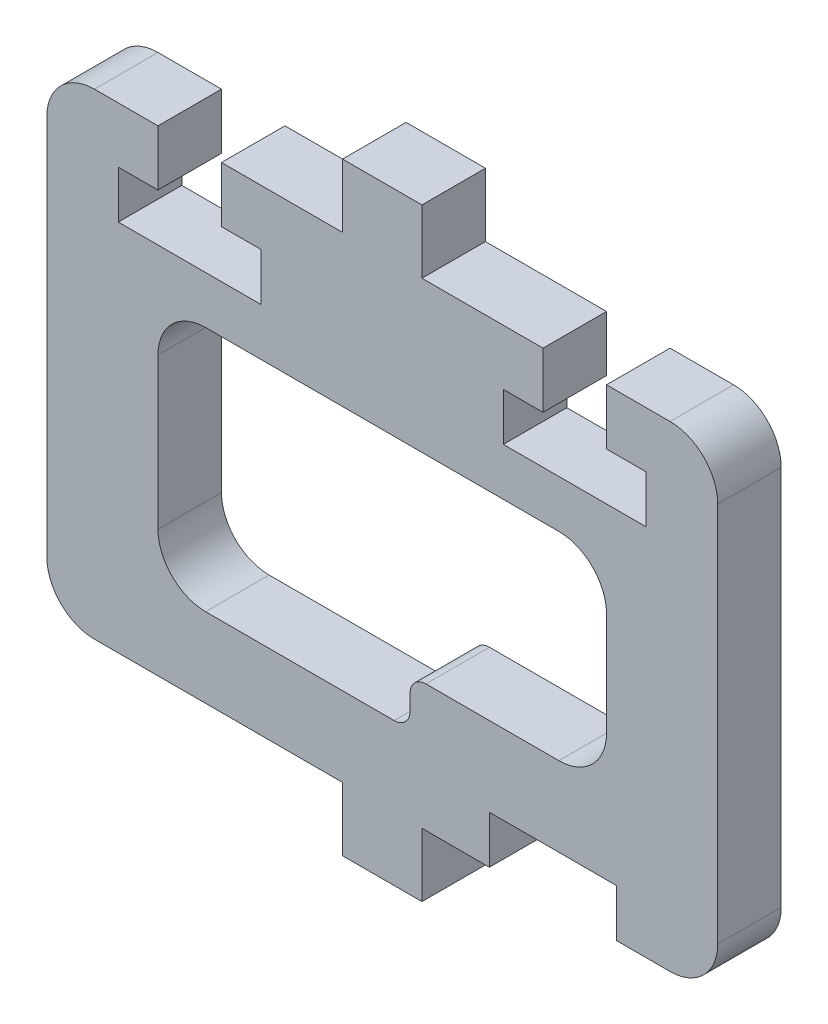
ISO-10303-21;
HEADER;
FILE_DESCRIPTION(('STEP AP214'),'2;1');
FILE_NAME('part.step','',(''),(''),'','','');
FILE_SCHEMA(('AUTOMOTIVE_DESIGN { 1 0 10303 214 1 1 1 1 }'));
ENDSEC;
DATA;
#1=APPLICATION_CONTEXT('core data for automotive mechanical design processes');
#2=APPLICATION_PROTOCOL_DEFINITION('international standard','automotive_design',2000,#1);
#3=PRODUCT_CONTEXT('',#1,'mechanical');
#4=PRODUCT('Part','Part','',(#3));
#5=PRODUCT_RELATED_PRODUCT_CATEGORY('part','',(#4));
#6=PRODUCT_DEFINITION_FORMATION('','',#4);
#7=PRODUCT_DEFINITION_CONTEXT('part definition',#1,'design');
#8=PRODUCT_DEFINITION('design','',#6,#7);
#9=PRODUCT_DEFINITION_SHAPE('','',#8);
#10=(LENGTH_UNIT() NAMED_UNIT(*) SI_UNIT(.MILLI.,.METRE.));
#11=(NAMED_UNIT(*) PLANE_ANGLE_UNIT() SI_UNIT($,.RADIAN.));
#12=(NAMED_UNIT(*) SI_UNIT($,.STERADIAN.) SOLID_ANGLE_UNIT());
#13=UNCERTAINTY_MEASURE_WITH_UNIT(LENGTH_MEASURE(1.E-05),#10,'distance_accuracy_value','');
#14=(GEOMETRIC_REPRESENTATION_CONTEXT(3) GLOBAL_UNCERTAINTY_ASSIGNED_CONTEXT((#13)) GLOBAL_UNIT_ASSIGNED_CONTEXT((#10,
#11,#12)) REPRESENTATION_CONTEXT('',''));
#15=CARTESIAN_POINT('',(0.,0.,0.));
#16=DIRECTION('',(0.,0.,1.));
#17=DIRECTION('',(1.,0.,0.));
#18=AXIS2_PLACEMENT_3D('',#15,#16,#17);
#19=CARTESIAN_POINT('',(-123.240102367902,-91.2219528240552,4.));
#20=DIRECTION('',(0.,0.,-1.));
#21=DIRECTION('',(-1.,0.,0.));
#22=AXIS2_PLACEMENT_3D('',#19,#20,#21);
#23=CYLINDRICAL_SURFACE('',#22,3.);
#24=CARTESIAN_POINT('',(-123.240102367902,-91.2219528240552,0.));
#25=DIRECTION('',(0.,0.,1.));
#26=DIRECTION('',(1.,0.,0.));
#27=AXIS2_PLACEMENT_3D('',#24,#25,#26);
#28=CIRCLE('',#27,3.);
#29=CARTESIAN_POINT('',(-126.240102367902,-91.2219528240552,0.));
#30=VERTEX_POINT('',#29);
#31=CARTESIAN_POINT('',(-123.240102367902,-94.2219528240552,0.));
#32=VERTEX_POINT('',#31);
#33=EDGE_CURVE('E420',#30,#32,#28,.T.);
#34=ORIENTED_EDGE('',*,*,#33,.T.);
#35=DIRECTION('',(0.,0.,-1.));
#36=VECTOR('',#35,1.);
#37=CARTESIAN_POINT('',(-123.240102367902,-94.2219528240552,4.));
#38=LINE('',#37,#36);
#39=CARTESIAN_POINT('',(-123.240102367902,-94.2219528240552,4.));
#40=VERTEX_POINT('',#39);
#41=EDGE_CURVE('E11',#40,#32,#38,.T.);
#42=ORIENTED_EDGE('',*,*,#41,.F.);
#43=CARTESIAN_POINT('',(-123.240102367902,-91.2219528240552,4.));
#44=DIRECTION('',(0.,0.,1.));
#45=DIRECTION('',(1.,0.,0.));
#46=AXIS2_PLACEMENT_3D('',#43,#44,#45);
#47=CIRCLE('',#46,3.);
#48=CARTESIAN_POINT('',(-126.240102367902,-91.2219528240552,4.));
#49=VERTEX_POINT('',#48);
#50=EDGE_CURVE('E440',#49,#40,#47,.T.);
#51=ORIENTED_EDGE('',*,*,#50,.F.);
#52=DIRECTION('',(0.,0.,-1.));
#53=VECTOR('',#52,1.);
#54=CARTESIAN_POINT('',(-126.240102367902,-91.2219528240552,4.));
#55=LINE('',#54,#53);
#56=EDGE_CURVE('E514',#49,#30,#55,.T.);
#57=ORIENTED_EDGE('',*,*,#56,.T.);
#58=EDGE_LOOP('',(#34,#42,#51,#57));
#59=FACE_BOUND('',#58,.T.);
#60=ADVANCED_FACE('F35',(#59),#23,.T.);
#61=CARTESIAN_POINT('',(-107.615102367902,-94.2219528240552,4.));
#62=DIRECTION('',(0.,1.,0.));
#63=DIRECTION('',(0.,0.,1.));
#64=AXIS2_PLACEMENT_3D('',#61,#62,#63);
#65=PLANE('',#64);
#66=DIRECTION('',(1.,0.,0.));
#67=VECTOR('',#66,1.);
#68=CARTESIAN_POINT('',(-107.615102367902,-94.2219528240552,0.));
#69=LINE('',#68,#67);
#70=CARTESIAN_POINT('',(-107.615102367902,-94.2219528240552,0.));
#71=VERTEX_POINT('',#70);
#72=EDGE_CURVE('E517',#32,#71,#69,.T.);
#73=ORIENTED_EDGE('',*,*,#72,.T.);
#74=DIRECTION('',(0.,0.,-1.));
#75=VECTOR('',#74,1.);
#76=CARTESIAN_POINT('',(-107.615102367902,-94.2219528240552,4.));
#77=LINE('',#76,#75);
#78=CARTESIAN_POINT('',(-107.615102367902,-94.2219528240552,4.));
#79=VERTEX_POINT('',#78);
#80=EDGE_CURVE('E42',#79,#71,#77,.T.);
#81=ORIENTED_EDGE('',*,*,#80,.F.);
#82=DIRECTION('',(1.,0.,0.));
#83=VECTOR('',#82,1.);
#84=CARTESIAN_POINT('',(-107.615102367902,-94.2219528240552,4.));
#85=LINE('',#84,#83);
#86=EDGE_CURVE('E443',#40,#79,#85,.T.);
#87=ORIENTED_EDGE('',*,*,#86,.F.);
#88=ORIENTED_EDGE('',*,*,#41,.T.);
#89=EDGE_LOOP('',(#73,#81,#87,#88));
#90=FACE_BOUND('',#89,.T.);
#91=ADVANCED_FACE('F713',(#90),#65,.F.);
#92=CARTESIAN_POINT('',(-107.615102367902,-98.2219528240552,4.));
#93=DIRECTION('',(1.,0.,0.));
#94=DIRECTION('',(0.,0.,-1.));
#95=AXIS2_PLACEMENT_3D('',#92,#93,#94);
#96=PLANE('',#95);
#97=DIRECTION('',(0.,-1.,0.));
#98=VECTOR('',#97,1.);
#99=CARTESIAN_POINT('',(-107.615102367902,-98.2219528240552,0.));
#100=LINE('',#99,#98);
#101=CARTESIAN_POINT('',(-107.615102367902,-98.2219528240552,0.));
#102=VERTEX_POINT('',#101);
#103=EDGE_CURVE('E519',#71,#102,#100,.T.);
#104=ORIENTED_EDGE('',*,*,#103,.T.);
#105=DIRECTION('',(0.,0.,-1.));
#106=VECTOR('',#105,1.);
#107=CARTESIAN_POINT('',(-107.615102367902,-98.2219528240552,4.));
#108=LINE('',#107,#106);
#109=CARTESIAN_POINT('',(-107.615102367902,-98.2219528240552,4.));
#110=VERTEX_POINT('',#109);
#111=EDGE_CURVE('E686',#110,#102,#108,.T.);
#112=ORIENTED_EDGE('',*,*,#111,.F.);
#113=DIRECTION('',(0.,-1.,0.));
#114=VECTOR('',#113,1.);
#115=CARTESIAN_POINT('',(-107.615102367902,-98.2219528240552,4.));
#116=LINE('',#115,#114);
#117=EDGE_CURVE('E446',#79,#110,#116,.T.);
#118=ORIENTED_EDGE('',*,*,#117,.F.);
#119=ORIENTED_EDGE('',*,*,#80,.T.);
#120=EDGE_LOOP('',(#104,#112,#118,#119));
#121=FACE_BOUND('',#120,.T.);
#122=ADVANCED_FACE('F693',(#121),#96,.F.);
#123=CARTESIAN_POINT('',(-105.115102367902,-98.2219528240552,4.));
#124=DIRECTION('',(0.,1.,0.));
#125=DIRECTION('',(0.,0.,1.));
#126=AXIS2_PLACEMENT_3D('',#123,#124,#125);
#127=PLANE('',#126);
#128=DIRECTION('',(1.,0.,0.));
#129=VECTOR('',#128,1.);
#130=CARTESIAN_POINT('',(-105.115102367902,-98.2219528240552,0.));
#131=LINE('',#130,#129);
#132=CARTESIAN_POINT('',(-102.615102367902,-98.2219528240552,0.));
#133=VERTEX_POINT('',#132);
#134=EDGE_CURVE('E522',#102,#133,#131,.T.);
#135=ORIENTED_EDGE('',*,*,#134,.T.);
#136=DIRECTION('',(0.,0.,-1.));
#137=VECTOR('',#136,1.);
#138=CARTESIAN_POINT('',(-102.615102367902,-98.2219528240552,4.));
#139=LINE('',#138,#137);
#140=CARTESIAN_POINT('',(-102.615102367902,-98.2219528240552,4.));
#141=VERTEX_POINT('',#140);
#142=EDGE_CURVE('E683',#141,#133,#139,.T.);
#143=ORIENTED_EDGE('',*,*,#142,.F.);
#144=DIRECTION('',(1.,0.,0.));
#145=VECTOR('',#144,1.);
#146=CARTESIAN_POINT('',(-107.615102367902,-98.2219528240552,4.));
#147=LINE('',#146,#145);
#148=EDGE_CURVE('E448',#110,#141,#147,.T.);
#149=ORIENTED_EDGE('',*,*,#148,.F.);
#150=ORIENTED_EDGE('',*,*,#111,.T.);
#151=EDGE_LOOP('',(#135,#143,#149,#150));
#152=FACE_BOUND('',#151,.T.);
#153=ADVANCED_FACE('F701',(#152),#127,.F.);
#154=CARTESIAN_POINT('',(-102.615102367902,-98.2219528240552,4.));
#155=DIRECTION('',(-1.,0.,0.));
#156=DIRECTION('',(0.,0.,1.));
#157=AXIS2_PLACEMENT_3D('',#154,#155,#156);
#158=PLANE('',#157);
#159=DIRECTION('',(0.,1.,0.));
#160=VECTOR('',#159,1.);
#161=CARTESIAN_POINT('',(-102.615102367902,-98.2219528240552,0.));
#162=LINE('',#161,#160);
#163=CARTESIAN_POINT('',(-102.615102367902,-94.2219528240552,0.));
#164=VERTEX_POINT('',#163);
#165=EDGE_CURVE('E524',#133,#164,#162,.T.);
#166=ORIENTED_EDGE('',*,*,#165,.T.);
#167=DIRECTION('',(0.,0.,-1.));
#168=VECTOR('',#167,1.);
#169=CARTESIAN_POINT('',(-102.615102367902,-94.2219528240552,4.));
#170=LINE('',#169,#168);
#171=CARTESIAN_POINT('',(-102.615102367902,-94.2219528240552,4.));
#172=VERTEX_POINT('',#171);
#173=EDGE_CURVE('E680',#172,#164,#170,.T.);
#174=ORIENTED_EDGE('',*,*,#173,.F.);
#175=DIRECTION('',(0.,1.,0.));
#176=VECTOR('',#175,1.);
#177=CARTESIAN_POINT('',(-102.615102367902,-98.2219528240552,4.));
#178=LINE('',#177,#176);
#179=EDGE_CURVE('E450',#141,#172,#178,.T.);
#180=ORIENTED_EDGE('',*,*,#179,.F.);
#181=ORIENTED_EDGE('',*,*,#142,.T.);
#182=EDGE_LOOP('',(#166,#174,#180,#181));
#183=FACE_BOUND('',#182,.T.);
#184=ADVANCED_FACE('F705',(#183),#158,.F.);
#185=CARTESIAN_POINT('',(-102.615102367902,-94.2219528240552,4.));
#186=DIRECTION('',(0.,1.,0.));
#187=DIRECTION('',(0.,0.,1.));
#188=AXIS2_PLACEMENT_3D('',#185,#186,#187);
#189=PLANE('',#188);
#190=DIRECTION('',(1.,0.,0.));
#191=VECTOR('',#190,1.);
#192=CARTESIAN_POINT('',(-102.615102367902,-94.2219528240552,0.));
#193=LINE('',#192,#191);
#194=CARTESIAN_POINT('',(-98.3651023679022,-94.2219528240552,0.));
#195=VERTEX_POINT('',#194);
#196=EDGE_CURVE('E526',#164,#195,#193,.T.);
#197=ORIENTED_EDGE('',*,*,#196,.T.);
#198=DIRECTION('',(0.,0.,-1.));
#199=VECTOR('',#198,1.);
#200=CARTESIAN_POINT('',(-98.3651023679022,-94.2219528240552,4.));
#201=LINE('',#200,#199);
#202=CARTESIAN_POINT('',(-98.3651023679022,-94.2219528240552,4.));
#203=VERTEX_POINT('',#202);
#204=EDGE_CURVE('E677',#203,#195,#201,.T.);
#205=ORIENTED_EDGE('',*,*,#204,.F.);
#206=DIRECTION('',(1.,0.,0.));
#207=VECTOR('',#206,1.);
#208=CARTESIAN_POINT('',(-102.615102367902,-94.2219528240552,4.));
#209=LINE('',#208,#207);
#210=EDGE_CURVE('E452',#172,#203,#209,.T.);
#211=ORIENTED_EDGE('',*,*,#210,.F.);
#212=ORIENTED_EDGE('',*,*,#173,.T.);
#213=EDGE_LOOP('',(#197,#205,#211,#212));
#214=FACE_BOUND('',#213,.T.);
#215=ADVANCED_FACE('F865',(#214),#189,.F.);
#216=CARTESIAN_POINT('',(-98.3651023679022,-94.2219528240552,4.));
#217=DIRECTION('',(-1.,0.,0.));
#218=DIRECTION('',(0.,0.,1.));
#219=AXIS2_PLACEMENT_3D('',#216,#217,#218);
#220=PLANE('',#219);
#221=DIRECTION('',(0.,1.,0.));
#222=VECTOR('',#221,1.);
#223=CARTESIAN_POINT('',(-98.3651023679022,-94.2219528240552,0.));
#224=LINE('',#223,#222);
#225=CARTESIAN_POINT('',(-98.3651023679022,-91.2219528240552,0.));
#226=VERTEX_POINT('',#225);
#227=EDGE_CURVE('E528',#195,#226,#224,.T.);
#228=ORIENTED_EDGE('',*,*,#227,.T.);
#229=DIRECTION('',(0.,0.,-1.));
#230=VECTOR('',#229,1.);
#231=CARTESIAN_POINT('',(-98.3651023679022,-91.2219528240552,4.));
#232=LINE('',#231,#230);
#233=CARTESIAN_POINT('',(-98.3651023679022,-91.2219528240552,4.));
#234=VERTEX_POINT('',#233);
#235=EDGE_CURVE('E674',#234,#226,#232,.T.);
#236=ORIENTED_EDGE('',*,*,#235,.F.);
#237=DIRECTION('',(0.,1.,0.));
#238=VECTOR('',#237,1.);
#239=CARTESIAN_POINT('',(-98.3651023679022,-94.2219528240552,4.));
#240=LINE('',#239,#238);
#241=EDGE_CURVE('E454',#203,#234,#240,.T.);
#242=ORIENTED_EDGE('',*,*,#241,.F.);
#243=ORIENTED_EDGE('',*,*,#204,.T.);
#244=EDGE_LOOP('',(#228,#236,#242,#243));
#245=FACE_BOUND('',#244,.T.);
#246=ADVANCED_FACE('F863',(#245),#220,.F.);
#247=CARTESIAN_POINT('',(-98.3651023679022,-91.2219528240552,4.));
#248=DIRECTION('',(0.,1.,0.));
#249=DIRECTION('',(0.,0.,1.));
#250=AXIS2_PLACEMENT_3D('',#247,#248,#249);
#251=PLANE('',#250);
#252=DIRECTION('',(1.,0.,0.));
#253=VECTOR('',#252,1.);
#254=CARTESIAN_POINT('',(-98.3651023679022,-91.2219528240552,0.));
#255=LINE('',#254,#253);
#256=CARTESIAN_POINT('',(-90.3651023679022,-91.2219528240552,0.));
#257=VERTEX_POINT('',#256);
#258=EDGE_CURVE('E530',#226,#257,#255,.T.);
#259=ORIENTED_EDGE('',*,*,#258,.T.);
#260=DIRECTION('',(0.,0.,-1.));
#261=VECTOR('',#260,1.);
#262=CARTESIAN_POINT('',(-90.3651023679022,-91.2219528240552,4.));
#263=LINE('',#262,#261);
#264=CARTESIAN_POINT('',(-90.3651023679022,-91.2219528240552,4.));
#265=VERTEX_POINT('',#264);
#266=EDGE_CURVE('E671',#265,#257,#263,.T.);
#267=ORIENTED_EDGE('',*,*,#266,.F.);
#268=DIRECTION('',(1.,0.,0.));
#269=VECTOR('',#268,1.);
#270=CARTESIAN_POINT('',(-98.3651023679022,-91.2219528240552,4.));
#271=LINE('',#270,#269);
#272=EDGE_CURVE('E456',#234,#265,#271,.T.);
#273=ORIENTED_EDGE('',*,*,#272,.F.);
#274=ORIENTED_EDGE('',*,*,#235,.T.);
#275=EDGE_LOOP('',(#259,#267,#273,#274));
#276=FACE_BOUND('',#275,.T.);
#277=ADVANCED_FACE('F859',(#276),#251,.F.);
#278=CARTESIAN_POINT('',(-90.3651023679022,-91.2219528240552,4.));
#279=DIRECTION('',(1.,0.,0.));
#280=DIRECTION('',(0.,0.,-1.));
#281=AXIS2_PLACEMENT_3D('',#278,#279,#280);
#282=PLANE('',#281);
#283=DIRECTION('',(0.,-1.,0.));
#284=VECTOR('',#283,1.);
#285=CARTESIAN_POINT('',(-90.3651023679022,-91.2219528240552,0.));
#286=LINE('',#285,#284);
#287=CARTESIAN_POINT('',(-90.3651023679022,-94.2219528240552,0.));
#288=VERTEX_POINT('',#287);
#289=EDGE_CURVE('E532',#257,#288,#286,.T.);
#290=ORIENTED_EDGE('',*,*,#289,.T.);
#291=DIRECTION('',(0.,0.,-1.));
#292=VECTOR('',#291,1.);
#293=CARTESIAN_POINT('',(-90.3651023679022,-94.2219528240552,4.));
#294=LINE('',#293,#292);
#295=CARTESIAN_POINT('',(-90.3651023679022,-94.2219528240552,4.));
#296=VERTEX_POINT('',#295);
#297=EDGE_CURVE('E668',#296,#288,#294,.T.);
#298=ORIENTED_EDGE('',*,*,#297,.F.);
#299=DIRECTION('',(0.,-1.,0.));
#300=VECTOR('',#299,1.);
#301=CARTESIAN_POINT('',(-90.3651023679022,-91.2219528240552,4.));
#302=LINE('',#301,#300);
#303=EDGE_CURVE('E458',#265,#296,#302,.T.);
#304=ORIENTED_EDGE('',*,*,#303,.F.);
#305=ORIENTED_EDGE('',*,*,#266,.T.);
#306=EDGE_LOOP('',(#290,#298,#304,#305));
#307=FACE_BOUND('',#306,.T.);
#308=ADVANCED_FACE('F854',(#307),#282,.F.);
#309=CARTESIAN_POINT('',(-86.9901023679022,-94.2219528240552,4.));
#310=DIRECTION('',(0.,1.,0.));
#311=DIRECTION('',(0.,0.,1.));
#312=AXIS2_PLACEMENT_3D('',#309,#310,#311);
#313=PLANE('',#312);
#314=DIRECTION('',(1.,0.,0.));
#315=VECTOR('',#314,1.);
#316=CARTESIAN_POINT('',(-86.9901023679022,-94.2219528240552,0.));
#317=LINE('',#316,#315);
#318=CARTESIAN_POINT('',(-86.9901023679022,-94.2219528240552,0.));
#319=VERTEX_POINT('',#318);
#320=EDGE_CURVE('E534',#288,#319,#317,.T.);
#321=ORIENTED_EDGE('',*,*,#320,.T.);
#322=DIRECTION('',(0.,0.,-1.));
#323=VECTOR('',#322,1.);
#324=CARTESIAN_POINT('',(-86.9901023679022,-94.2219528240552,4.));
#325=LINE('',#324,#323);
#326=CARTESIAN_POINT('',(-86.9901023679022,-94.2219528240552,4.));
#327=VERTEX_POINT('',#326);
#328=EDGE_CURVE('E665',#327,#319,#325,.T.);
#329=ORIENTED_EDGE('',*,*,#328,.F.);
#330=DIRECTION('',(1.,0.,0.));
#331=VECTOR('',#330,1.);
#332=CARTESIAN_POINT('',(-86.9901023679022,-94.2219528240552,4.));
#333=LINE('',#332,#331);
#334=EDGE_CURVE('E460',#296,#327,#333,.T.);
#335=ORIENTED_EDGE('',*,*,#334,.F.);
#336=ORIENTED_EDGE('',*,*,#297,.T.);
#337=EDGE_LOOP('',(#321,#329,#335,#336));
#338=FACE_BOUND('',#337,.T.);
#339=ADVANCED_FACE('F848',(#338),#313,.F.);
#340=CARTESIAN_POINT('',(-86.9901023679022,-91.2219528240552,4.));
#341=DIRECTION('',(0.,0.,-1.));
#342=DIRECTION('',(-1.,0.,0.));
#343=AXIS2_PLACEMENT_3D('',#340,#341,#342);
#344=CYLINDRICAL_SURFACE('',#343,3.);
#345=CARTESIAN_POINT('',(-86.9901023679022,-91.2219528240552,0.));
#346=DIRECTION('',(0.,0.,1.));
#347=DIRECTION('',(1.,0.,0.));
#348=AXIS2_PLACEMENT_3D('',#345,#346,#347);
#349=CIRCLE('',#348,3.);
#350=CARTESIAN_POINT('',(-83.9901023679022,-91.2219528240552,0.));
#351=VERTEX_POINT('',#350);
#352=EDGE_CURVE('E536',#319,#351,#349,.T.);
#353=ORIENTED_EDGE('',*,*,#352,.T.);
#354=DIRECTION('',(0.,0.,-1.));
#355=VECTOR('',#354,1.);
#356=CARTESIAN_POINT('',(-83.9901023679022,-91.2219528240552,4.));
#357=LINE('',#356,#355);
#358=CARTESIAN_POINT('',(-83.9901023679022,-91.2219528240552,4.));
#359=VERTEX_POINT('',#358);
#360=EDGE_CURVE('E662',#359,#351,#357,.T.);
#361=ORIENTED_EDGE('',*,*,#360,.F.);
#362=CARTESIAN_POINT('',(-86.9901023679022,-91.2219528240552,4.));
#363=DIRECTION('',(0.,0.,1.));
#364=DIRECTION('',(1.,0.,0.));
#365=AXIS2_PLACEMENT_3D('',#362,#363,#364);
#366=CIRCLE('',#365,3.);
#367=EDGE_CURVE('E462',#327,#359,#366,.T.);
#368=ORIENTED_EDGE('',*,*,#367,.F.);
#369=ORIENTED_EDGE('',*,*,#328,.T.);
#370=EDGE_LOOP('',(#353,#361,#368,#369));
#371=FACE_BOUND('',#370,.T.);
#372=ADVANCED_FACE('F844',(#371),#344,.T.);
#373=CARTESIAN_POINT('',(-83.9901023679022,-91.2219528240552,4.));
#374=DIRECTION('',(-1.,0.,0.));
#375=DIRECTION('',(0.,0.,1.));
#376=AXIS2_PLACEMENT_3D('',#373,#374,#375);
#377=PLANE('',#376);
#378=DIRECTION('',(0.,1.,0.));
#379=VECTOR('',#378,1.);
#380=CARTESIAN_POINT('',(-83.9901023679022,-91.2219528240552,0.));
#381=LINE('',#380,#379);
#382=CARTESIAN_POINT('',(-83.9901023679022,-67.2219528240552,0.));
#383=VERTEX_POINT('',#382);
#384=EDGE_CURVE('E538',#351,#383,#381,.T.);
#385=ORIENTED_EDGE('',*,*,#384,.T.);
#386=DIRECTION('',(0.,0.,-1.));
#387=VECTOR('',#386,1.);
#388=CARTESIAN_POINT('',(-83.9901023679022,-67.2219528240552,4.));
#389=LINE('',#388,#387);
#390=CARTESIAN_POINT('',(-83.9901023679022,-67.2219528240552,4.));
#391=VERTEX_POINT('',#390);
#392=EDGE_CURVE('E659',#391,#383,#389,.T.);
#393=ORIENTED_EDGE('',*,*,#392,.F.);
#394=DIRECTION('',(0.,1.,0.));
#395=VECTOR('',#394,1.);
#396=CARTESIAN_POINT('',(-83.9901023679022,-91.2219528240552,4.));
#397=LINE('',#396,#395);
#398=EDGE_CURVE('E464',#359,#391,#397,.T.);
#399=ORIENTED_EDGE('',*,*,#398,.F.);
#400=ORIENTED_EDGE('',*,*,#360,.T.);
#401=EDGE_LOOP('',(#385,#393,#399,#400));
#402=FACE_BOUND('',#401,.T.);
#403=ADVANCED_FACE('F839',(#402),#377,.F.);
#404=CARTESIAN_POINT('',(-86.9901023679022,-67.2219528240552,4.));
#405=DIRECTION('',(0.,0.,-1.));
#406=DIRECTION('',(-1.,0.,0.));
#407=AXIS2_PLACEMENT_3D('',#404,#405,#406);
#408=CYLINDRICAL_SURFACE('',#407,3.);
#409=CARTESIAN_POINT('',(-86.9901023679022,-67.2219528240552,0.));
#410=DIRECTION('',(0.,0.,1.));
#411=DIRECTION('',(1.,0.,0.));
#412=AXIS2_PLACEMENT_3D('',#409,#410,#411);
#413=CIRCLE('',#412,3.);
#414=CARTESIAN_POINT('',(-86.9901023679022,-64.2219528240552,0.));
#415=VERTEX_POINT('',#414);
#416=EDGE_CURVE('E540',#383,#415,#413,.T.);
#417=ORIENTED_EDGE('',*,*,#416,.T.);
#418=DIRECTION('',(0.,0.,-1.));
#419=VECTOR('',#418,1.);
#420=CARTESIAN_POINT('',(-86.9901023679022,-64.2219528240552,4.));
#421=LINE('',#420,#419);
#422=CARTESIAN_POINT('',(-86.9901023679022,-64.2219528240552,4.));
#423=VERTEX_POINT('',#422);
#424=EDGE_CURVE('E656',#423,#415,#421,.T.);
#425=ORIENTED_EDGE('',*,*,#424,.F.);
#426=CARTESIAN_POINT('',(-86.9901023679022,-67.2219528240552,4.));
#427=DIRECTION('',(0.,0.,1.));
#428=DIRECTION('',(1.,0.,0.));
#429=AXIS2_PLACEMENT_3D('',#426,#427,#428);
#430=CIRCLE('',#429,3.);
#431=EDGE_CURVE('E466',#391,#423,#430,.T.);
#432=ORIENTED_EDGE('',*,*,#431,.F.);
#433=ORIENTED_EDGE('',*,*,#392,.T.);
#434=EDGE_LOOP('',(#417,#425,#432,#433));
#435=FACE_BOUND('',#434,.T.);
#436=ADVANCED_FACE('F833',(#435),#408,.T.);
#437=CARTESIAN_POINT('',(-90.9901023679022,-64.2219528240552,4.));
#438=DIRECTION('',(0.,-1.,0.));
#439=DIRECTION('',(0.,0.,-1.));
#440=AXIS2_PLACEMENT_3D('',#437,#438,#439);
#441=PLANE('',#440);
#442=DIRECTION('',(-1.,0.,0.));
#443=VECTOR('',#442,1.);
#444=CARTESIAN_POINT('',(-90.9901023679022,-64.2219528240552,0.));
#445=LINE('',#444,#443);
#446=CARTESIAN_POINT('',(-90.9901023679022,-64.2219528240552,0.));
#447=VERTEX_POINT('',#446);
#448=EDGE_CURVE('E542',#415,#447,#445,.T.);
#449=ORIENTED_EDGE('',*,*,#448,.T.);
#450=DIRECTION('',(0.,0.,-1.));
#451=VECTOR('',#450,1.);
#452=CARTESIAN_POINT('',(-90.9901023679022,-64.2219528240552,4.));
#453=LINE('',#452,#451);
#454=CARTESIAN_POINT('',(-90.9901023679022,-64.2219528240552,4.));
#455=VERTEX_POINT('',#454);
#456=EDGE_CURVE('E653',#455,#447,#453,.T.);
#457=ORIENTED_EDGE('',*,*,#456,.F.);
#458=DIRECTION('',(-1.,0.,0.));
#459=VECTOR('',#458,1.);
#460=CARTESIAN_POINT('',(-90.9901023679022,-64.2219528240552,4.));
#461=LINE('',#460,#459);
#462=EDGE_CURVE('E468',#423,#455,#461,.T.);
#463=ORIENTED_EDGE('',*,*,#462,.F.);
#464=ORIENTED_EDGE('',*,*,#424,.T.);
#465=EDGE_LOOP('',(#449,#457,#463,#464));
#466=FACE_BOUND('',#465,.T.);
#467=ADVANCED_FACE('F829',(#466),#441,.F.);
#468=CARTESIAN_POINT('',(-90.9901023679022,-67.7219528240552,4.));
#469=DIRECTION('',(1.,0.,0.));
#470=DIRECTION('',(0.,1.,0.));
#471=AXIS2_PLACEMENT_3D('',#468,#469,#470);
#472=PLANE('',#471);
#473=DIRECTION('',(0.,-1.,0.));
#474=VECTOR('',#473,1.);
#475=CARTESIAN_POINT('',(-90.9901023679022,-67.7219528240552,0.));
#476=LINE('',#475,#474);
#477=CARTESIAN_POINT('',(-90.9901023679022,-67.7219528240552,0.));
#478=VERTEX_POINT('',#477);
#479=EDGE_CURVE('E544',#447,#478,#476,.T.);
#480=ORIENTED_EDGE('',*,*,#479,.T.);
#481=DIRECTION('',(0.,0.,-1.));
#482=VECTOR('',#481,1.);
#483=CARTESIAN_POINT('',(-90.9901023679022,-67.7219528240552,4.));
#484=LINE('',#483,#482);
#485=CARTESIAN_POINT('',(-90.9901023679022,-67.7219528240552,4.));
#486=VERTEX_POINT('',#485);
#487=EDGE_CURVE('E650',#486,#478,#484,.T.);
#488=ORIENTED_EDGE('',*,*,#487,.F.);
#489=DIRECTION('',(0.,-1.,0.));
#490=VECTOR('',#489,1.);
#491=CARTESIAN_POINT('',(-90.9901023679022,-67.7219528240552,4.));
#492=LINE('',#491,#490);
#493=EDGE_CURVE('E470',#455,#486,#492,.T.);
#494=ORIENTED_EDGE('',*,*,#493,.F.);
#495=ORIENTED_EDGE('',*,*,#456,.T.);
#496=EDGE_LOOP('',(#480,#488,#494,#495));
#497=FACE_BOUND('',#496,.T.);
#498=ADVANCED_FACE('F824',(#497),#472,.F.);
#499=CARTESIAN_POINT('',(-88.4901023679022,-67.7219528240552,4.));
#500=DIRECTION('',(0.,1.,0.));
#501=DIRECTION('',(0.,0.,1.));
#502=AXIS2_PLACEMENT_3D('',#499,#500,#501);
#503=PLANE('',#502);
#504=DIRECTION('',(1.,0.,0.));
#505=VECTOR('',#504,1.);
#506=CARTESIAN_POINT('',(-88.4901023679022,-67.7219528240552,0.));
#507=LINE('',#506,#505);
#508=CARTESIAN_POINT('',(-88.4901023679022,-67.7219528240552,0.));
#509=VERTEX_POINT('',#508);
#510=EDGE_CURVE('E546',#478,#509,#507,.T.);
#511=ORIENTED_EDGE('',*,*,#510,.T.);
#512=DIRECTION('',(0.,0.,-1.));
#513=VECTOR('',#512,1.);
#514=CARTESIAN_POINT('',(-88.4901023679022,-67.7219528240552,4.));
#515=LINE('',#514,#513);
#516=CARTESIAN_POINT('',(-88.4901023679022,-67.7219528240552,4.));
#517=VERTEX_POINT('',#516);
#518=EDGE_CURVE('E647',#517,#509,#515,.T.);
#519=ORIENTED_EDGE('',*,*,#518,.F.);
#520=DIRECTION('',(1.,0.,0.));
#521=VECTOR('',#520,1.);
#522=CARTESIAN_POINT('',(-88.4901023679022,-67.7219528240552,4.));
#523=LINE('',#522,#521);
#524=EDGE_CURVE('E472',#486,#517,#523,.T.);
#525=ORIENTED_EDGE('',*,*,#524,.F.);
#526=ORIENTED_EDGE('',*,*,#487,.T.);
#527=EDGE_LOOP('',(#511,#519,#525,#526));
#528=FACE_BOUND('',#527,.T.);
#529=ADVANCED_FACE('F818',(#528),#503,.F.);
#530=CARTESIAN_POINT('',(-88.4901023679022,-70.7219528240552,4.));
#531=DIRECTION('',(1.,0.,0.));
#532=DIRECTION('',(0.,0.,-1.));
#533=AXIS2_PLACEMENT_3D('',#530,#531,#532);
#534=PLANE('',#533);
#535=DIRECTION('',(0.,-1.,0.));
#536=VECTOR('',#535,1.);
#537=CARTESIAN_POINT('',(-88.4901023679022,-70.7219528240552,0.));
#538=LINE('',#537,#536);
#539=CARTESIAN_POINT('',(-88.4901023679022,-70.7219528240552,0.));
#540=VERTEX_POINT('',#539);
#541=EDGE_CURVE('E548',#509,#540,#538,.T.);
#542=ORIENTED_EDGE('',*,*,#541,.T.);
#543=DIRECTION('',(0.,0.,-1.));
#544=VECTOR('',#543,1.);
#545=CARTESIAN_POINT('',(-88.4901023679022,-70.7219528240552,4.));
#546=LINE('',#545,#544);
#547=CARTESIAN_POINT('',(-88.4901023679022,-70.7219528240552,4.));
#548=VERTEX_POINT('',#547);
#549=EDGE_CURVE('E644',#548,#540,#546,.T.);
#550=ORIENTED_EDGE('',*,*,#549,.F.);
#551=DIRECTION('',(0.,-1.,0.));
#552=VECTOR('',#551,1.);
#553=CARTESIAN_POINT('',(-88.4901023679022,-70.7219528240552,4.));
#554=LINE('',#553,#552);
#555=EDGE_CURVE('E474',#517,#548,#554,.T.);
#556=ORIENTED_EDGE('',*,*,#555,.F.);
#557=ORIENTED_EDGE('',*,*,#518,.T.);
#558=EDGE_LOOP('',(#542,#550,#556,#557));
#559=FACE_BOUND('',#558,.T.);
#560=ADVANCED_FACE('F814',(#559),#534,.F.);
#561=CARTESIAN_POINT('',(-97.4901023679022,-70.7219528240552,4.));
#562=DIRECTION('',(0.,-1.,0.));
#563=DIRECTION('',(0.,0.,-1.));
#564=AXIS2_PLACEMENT_3D('',#561,#562,#563);
#565=PLANE('',#564);
#566=DIRECTION('',(-1.,0.,0.));
#567=VECTOR('',#566,1.);
#568=CARTESIAN_POINT('',(-97.4901023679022,-70.7219528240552,0.));
#569=LINE('',#568,#567);
#570=CARTESIAN_POINT('',(-97.4901023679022,-70.7219528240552,0.));
#571=VERTEX_POINT('',#570);
#572=EDGE_CURVE('E550',#540,#571,#569,.T.);
#573=ORIENTED_EDGE('',*,*,#572,.T.);
#574=DIRECTION('',(0.,0.,-1.));
#575=VECTOR('',#574,1.);
#576=CARTESIAN_POINT('',(-97.4901023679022,-70.7219528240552,4.));
#577=LINE('',#576,#575);
#578=CARTESIAN_POINT('',(-97.4901023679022,-70.7219528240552,4.));
#579=VERTEX_POINT('',#578);
#580=EDGE_CURVE('E641',#579,#571,#577,.T.);
#581=ORIENTED_EDGE('',*,*,#580,.F.);
#582=DIRECTION('',(-1.,0.,0.));
#583=VECTOR('',#582,1.);
#584=CARTESIAN_POINT('',(-97.4901023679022,-70.7219528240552,4.));
#585=LINE('',#584,#583);
#586=EDGE_CURVE('E476',#548,#579,#585,.T.);
#587=ORIENTED_EDGE('',*,*,#586,.F.);
#588=ORIENTED_EDGE('',*,*,#549,.T.);
#589=EDGE_LOOP('',(#573,#581,#587,#588));
#590=FACE_BOUND('',#589,.T.);
#591=ADVANCED_FACE('F809',(#590),#565,.F.);
#592=CARTESIAN_POINT('',(-97.4901023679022,-67.7219528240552,4.));
#593=DIRECTION('',(-1.,0.,0.));
#594=DIRECTION('',(0.,0.,1.));
#595=AXIS2_PLACEMENT_3D('',#592,#593,#594);
#596=PLANE('',#595);
#597=DIRECTION('',(0.,1.,0.));
#598=VECTOR('',#597,1.);
#599=CARTESIAN_POINT('',(-97.4901023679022,-67.7219528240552,0.));
#600=LINE('',#599,#598);
#601=CARTESIAN_POINT('',(-97.4901023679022,-67.7219528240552,0.));
#602=VERTEX_POINT('',#601);
#603=EDGE_CURVE('E552',#571,#602,#600,.T.);
#604=ORIENTED_EDGE('',*,*,#603,.T.);
#605=DIRECTION('',(0.,0.,-1.));
#606=VECTOR('',#605,1.);
#607=CARTESIAN_POINT('',(-97.4901023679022,-67.7219528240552,4.));
#608=LINE('',#607,#606);
#609=CARTESIAN_POINT('',(-97.4901023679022,-67.7219528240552,4.));
#610=VERTEX_POINT('',#609);
#611=EDGE_CURVE('E638',#610,#602,#608,.T.);
#612=ORIENTED_EDGE('',*,*,#611,.F.);
#613=DIRECTION('',(0.,1.,0.));
#614=VECTOR('',#613,1.);
#615=CARTESIAN_POINT('',(-97.4901023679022,-67.7219528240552,4.));
#616=LINE('',#615,#614);
#617=EDGE_CURVE('E478',#579,#610,#616,.T.);
#618=ORIENTED_EDGE('',*,*,#617,.F.);
#619=ORIENTED_EDGE('',*,*,#580,.T.);
#620=EDGE_LOOP('',(#604,#612,#618,#619));
#621=FACE_BOUND('',#620,.T.);
#622=ADVANCED_FACE('F803',(#621),#596,.F.);
#623=CARTESIAN_POINT('',(-94.9901023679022,-67.7219528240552,4.));
#624=DIRECTION('',(0.,1.,0.));
#625=DIRECTION('',(0.,0.,1.));
#626=AXIS2_PLACEMENT_3D('',#623,#624,#625);
#627=PLANE('',#626);
#628=DIRECTION('',(1.,0.,0.));
#629=VECTOR('',#628,1.);
#630=CARTESIAN_POINT('',(-94.9901023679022,-67.7219528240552,0.));
#631=LINE('',#630,#629);
#632=CARTESIAN_POINT('',(-94.9901023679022,-67.7219528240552,0.));
#633=VERTEX_POINT('',#632);
#634=EDGE_CURVE('E554',#602,#633,#631,.T.);
#635=ORIENTED_EDGE('',*,*,#634,.T.);
#636=DIRECTION('',(0.,0.,-1.));
#637=VECTOR('',#636,1.);
#638=CARTESIAN_POINT('',(-94.9901023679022,-67.7219528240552,4.));
#639=LINE('',#638,#637);
#640=CARTESIAN_POINT('',(-94.9901023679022,-67.7219528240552,4.));
#641=VERTEX_POINT('',#640);
#642=EDGE_CURVE('E635',#641,#633,#639,.T.);
#643=ORIENTED_EDGE('',*,*,#642,.F.);
#644=DIRECTION('',(1.,0.,0.));
#645=VECTOR('',#644,1.);
#646=CARTESIAN_POINT('',(-94.9901023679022,-67.7219528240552,4.));
#647=LINE('',#646,#645);
#648=EDGE_CURVE('E480',#610,#641,#647,.T.);
#649=ORIENTED_EDGE('',*,*,#648,.F.);
#650=ORIENTED_EDGE('',*,*,#611,.T.);
#651=EDGE_LOOP('',(#635,#643,#649,#650));
#652=FACE_BOUND('',#651,.T.);
#653=ADVANCED_FACE('F799',(#652),#627,.F.);
#654=CARTESIAN_POINT('',(-94.9901023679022,-64.2219528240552,4.));
#655=DIRECTION('',(-1.,0.,0.));
#656=DIRECTION('',(0.,-1.,0.));
#657=AXIS2_PLACEMENT_3D('',#654,#655,#656);
#658=PLANE('',#657);
#659=DIRECTION('',(0.,1.,0.));
#660=VECTOR('',#659,1.);
#661=CARTESIAN_POINT('',(-94.9901023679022,-64.2219528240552,0.));
#662=LINE('',#661,#660);
#663=CARTESIAN_POINT('',(-94.9901023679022,-64.2219528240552,0.));
#664=VERTEX_POINT('',#663);
#665=EDGE_CURVE('E556',#633,#664,#662,.T.);
#666=ORIENTED_EDGE('',*,*,#665,.T.);
#667=DIRECTION('',(0.,0.,-1.));
#668=VECTOR('',#667,1.);
#669=CARTESIAN_POINT('',(-94.9901023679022,-64.2219528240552,4.));
#670=LINE('',#669,#668);
#671=CARTESIAN_POINT('',(-94.9901023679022,-64.2219528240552,4.));
#672=VERTEX_POINT('',#671);
#673=EDGE_CURVE('E632',#672,#664,#670,.T.);
#674=ORIENTED_EDGE('',*,*,#673,.F.);
#675=DIRECTION('',(0.,1.,0.));
#676=VECTOR('',#675,1.);
#677=CARTESIAN_POINT('',(-94.9901023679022,-64.2219528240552,4.));
#678=LINE('',#677,#676);
#679=EDGE_CURVE('E482',#641,#672,#678,.T.);
#680=ORIENTED_EDGE('',*,*,#679,.F.);
#681=ORIENTED_EDGE('',*,*,#642,.T.);
#682=EDGE_LOOP('',(#666,#674,#680,#681));
#683=FACE_BOUND('',#682,.T.);
#684=ADVANCED_FACE('F795',(#683),#658,.F.);
#685=CARTESIAN_POINT('',(-102.615102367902,-64.2219528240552,4.));
#686=DIRECTION('',(0.,-1.,0.));
#687=DIRECTION('',(0.,0.,-1.));
#688=AXIS2_PLACEMENT_3D('',#685,#686,#687);
#689=PLANE('',#688);
#690=DIRECTION('',(-1.,0.,0.));
#691=VECTOR('',#690,1.);
#692=CARTESIAN_POINT('',(-102.615102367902,-64.2219528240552,0.));
#693=LINE('',#692,#691);
#694=CARTESIAN_POINT('',(-102.615102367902,-64.2219528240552,0.));
#695=VERTEX_POINT('',#694);
#696=EDGE_CURVE('E558',#664,#695,#693,.T.);
#697=ORIENTED_EDGE('',*,*,#696,.T.);
#698=DIRECTION('',(0.,0.,-1.));
#699=VECTOR('',#698,1.);
#700=CARTESIAN_POINT('',(-102.615102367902,-64.2219528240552,4.));
#701=LINE('',#700,#699);
#702=CARTESIAN_POINT('',(-102.615102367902,-64.2219528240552,4.));
#703=VERTEX_POINT('',#702);
#704=EDGE_CURVE('E629',#703,#695,#701,.T.);
#705=ORIENTED_EDGE('',*,*,#704,.F.);
#706=DIRECTION('',(-1.,0.,0.));
#707=VECTOR('',#706,1.);
#708=CARTESIAN_POINT('',(-102.615102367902,-64.2219528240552,4.));
#709=LINE('',#708,#707);
#710=EDGE_CURVE('E484',#672,#703,#709,.T.);
#711=ORIENTED_EDGE('',*,*,#710,.F.);
#712=ORIENTED_EDGE('',*,*,#673,.T.);
#713=EDGE_LOOP('',(#697,#705,#711,#712));
#714=FACE_BOUND('',#713,.T.);
#715=ADVANCED_FACE('F790',(#714),#689,.F.);
#716=CARTESIAN_POINT('',(-102.615102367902,-60.2219528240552,4.));
#717=DIRECTION('',(-1.,0.,0.));
#718=DIRECTION('',(0.,0.,1.));
#719=AXIS2_PLACEMENT_3D('',#716,#717,#718);
#720=PLANE('',#719);
#721=DIRECTION('',(0.,1.,0.));
#722=VECTOR('',#721,1.);
#723=CARTESIAN_POINT('',(-102.615102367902,-60.2219528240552,0.));
#724=LINE('',#723,#722);
#725=CARTESIAN_POINT('',(-102.615102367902,-60.2219528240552,0.));
#726=VERTEX_POINT('',#725);
#727=EDGE_CURVE('E560',#695,#726,#724,.T.);
#728=ORIENTED_EDGE('',*,*,#727,.T.);
#729=DIRECTION('',(0.,0.,-1.));
#730=VECTOR('',#729,1.);
#731=CARTESIAN_POINT('',(-102.615102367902,-60.2219528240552,4.));
#732=LINE('',#731,#730);
#733=CARTESIAN_POINT('',(-102.615102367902,-60.2219528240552,4.));
#734=VERTEX_POINT('',#733);
#735=EDGE_CURVE('E626',#734,#726,#732,.T.);
#736=ORIENTED_EDGE('',*,*,#735,.F.);
#737=DIRECTION('',(0.,1.,0.));
#738=VECTOR('',#737,1.);
#739=CARTESIAN_POINT('',(-102.615102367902,-60.2219528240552,4.));
#740=LINE('',#739,#738);
#741=EDGE_CURVE('E486',#703,#734,#740,.T.);
#742=ORIENTED_EDGE('',*,*,#741,.F.);
#743=ORIENTED_EDGE('',*,*,#704,.T.);
#744=EDGE_LOOP('',(#728,#736,#742,#743));
#745=FACE_BOUND('',#744,.T.);
#746=ADVANCED_FACE('F781',(#745),#720,.F.);
#747=CARTESIAN_POINT('',(-107.615102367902,-60.2219528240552,4.));
#748=DIRECTION('',(0.,-1.,0.));
#749=DIRECTION('',(0.,0.,-1.));
#750=AXIS2_PLACEMENT_3D('',#747,#748,#749);
#751=PLANE('',#750);
#752=DIRECTION('',(-1.,0.,0.));
#753=VECTOR('',#752,1.);
#754=CARTESIAN_POINT('',(-107.615102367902,-60.2219528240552,0.));
#755=LINE('',#754,#753);
#756=CARTESIAN_POINT('',(-107.615102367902,-60.2219528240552,0.));
#757=VERTEX_POINT('',#756);
#758=EDGE_CURVE('E563',#726,#757,#755,.T.);
#759=ORIENTED_EDGE('',*,*,#758,.T.);
#760=DIRECTION('',(0.,0.,-1.));
#761=VECTOR('',#760,1.);
#762=CARTESIAN_POINT('',(-107.615102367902,-60.2219528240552,4.));
#763=LINE('',#762,#761);
#764=CARTESIAN_POINT('',(-107.615102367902,-60.2219528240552,4.));
#765=VERTEX_POINT('',#764);
#766=EDGE_CURVE('E623',#765,#757,#763,.T.);
#767=ORIENTED_EDGE('',*,*,#766,.F.);
#768=DIRECTION('',(-1.,0.,0.));
#769=VECTOR('',#768,1.);
#770=CARTESIAN_POINT('',(-105.115102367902,-60.2219528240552,4.));
#771=LINE('',#770,#769);
#772=EDGE_CURVE('E488',#734,#765,#771,.T.);
#773=ORIENTED_EDGE('',*,*,#772,.F.);
#774=ORIENTED_EDGE('',*,*,#735,.T.);
#775=EDGE_LOOP('',(#759,#767,#773,#774));
#776=FACE_BOUND('',#775,.T.);
#777=ADVANCED_FACE('F785',(#776),#751,.F.);
#778=CARTESIAN_POINT('',(-107.615102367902,-60.2219528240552,4.));
#779=DIRECTION('',(1.,0.,0.));
#780=DIRECTION('',(0.,0.,-1.));
#781=AXIS2_PLACEMENT_3D('',#778,#779,#780);
#782=PLANE('',#781);
#783=DIRECTION('',(0.,-1.,0.));
#784=VECTOR('',#783,1.);
#785=CARTESIAN_POINT('',(-107.615102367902,-60.2219528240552,0.));
#786=LINE('',#785,#784);
#787=CARTESIAN_POINT('',(-107.615102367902,-64.2219528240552,0.));
#788=VERTEX_POINT('',#787);
#789=EDGE_CURVE('E565',#757,#788,#786,.T.);
#790=ORIENTED_EDGE('',*,*,#789,.T.);
#791=DIRECTION('',(0.,0.,-1.));
#792=VECTOR('',#791,1.);
#793=CARTESIAN_POINT('',(-107.615102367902,-64.2219528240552,4.));
#794=LINE('',#793,#792);
#795=CARTESIAN_POINT('',(-107.615102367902,-64.2219528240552,4.));
#796=VERTEX_POINT('',#795);
#797=EDGE_CURVE('E620',#796,#788,#794,.T.);
#798=ORIENTED_EDGE('',*,*,#797,.F.);
#799=DIRECTION('',(0.,-1.,0.));
#800=VECTOR('',#799,1.);
#801=CARTESIAN_POINT('',(-107.615102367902,-60.2219528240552,4.));
#802=LINE('',#801,#800);
#803=EDGE_CURVE('E490',#765,#796,#802,.T.);
#804=ORIENTED_EDGE('',*,*,#803,.F.);
#805=ORIENTED_EDGE('',*,*,#766,.T.);
#806=EDGE_LOOP('',(#790,#798,#804,#805));
#807=FACE_BOUND('',#806,.T.);
#808=ADVANCED_FACE('F774',(#807),#782,.F.);
#809=CARTESIAN_POINT('',(-107.615102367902,-64.2219528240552,4.));
#810=DIRECTION('',(0.,-1.,0.));
#811=DIRECTION('',(0.,0.,-1.));
#812=AXIS2_PLACEMENT_3D('',#809,#810,#811);
#813=PLANE('',#812);
#814=DIRECTION('',(-1.,0.,0.));
#815=VECTOR('',#814,1.);
#816=CARTESIAN_POINT('',(-107.615102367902,-64.2219528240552,0.));
#817=LINE('',#816,#815);
#818=CARTESIAN_POINT('',(-115.240102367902,-64.2219528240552,0.));
#819=VERTEX_POINT('',#818);
#820=EDGE_CURVE('E567',#788,#819,#817,.T.);
#821=ORIENTED_EDGE('',*,*,#820,.T.);
#822=DIRECTION('',(0.,0.,-1.));
#823=VECTOR('',#822,1.);
#824=CARTESIAN_POINT('',(-115.240102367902,-64.2219528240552,4.));
#825=LINE('',#824,#823);
#826=CARTESIAN_POINT('',(-115.240102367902,-64.2219528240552,4.));
#827=VERTEX_POINT('',#826);
#828=EDGE_CURVE('E617',#827,#819,#825,.T.);
#829=ORIENTED_EDGE('',*,*,#828,.F.);
#830=DIRECTION('',(-1.,0.,0.));
#831=VECTOR('',#830,1.);
#832=CARTESIAN_POINT('',(-107.615102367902,-64.2219528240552,4.));
#833=LINE('',#832,#831);
#834=EDGE_CURVE('E492',#796,#827,#833,.T.);
#835=ORIENTED_EDGE('',*,*,#834,.F.);
#836=ORIENTED_EDGE('',*,*,#797,.T.);
#837=EDGE_LOOP('',(#821,#829,#835,#836));
#838=FACE_BOUND('',#837,.T.);
#839=ADVANCED_FACE('F770',(#838),#813,.F.);
#840=CARTESIAN_POINT('',(-115.240102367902,-64.2219528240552,4.));
#841=DIRECTION('',(1.,0.,0.));
#842=DIRECTION('',(0.,0.,-1.));
#843=AXIS2_PLACEMENT_3D('',#840,#841,#842);
#844=PLANE('',#843);
#845=DIRECTION('',(0.,-1.,0.));
#846=VECTOR('',#845,1.);
#847=CARTESIAN_POINT('',(-115.240102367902,-64.2219528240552,0.));
#848=LINE('',#847,#846);
#849=CARTESIAN_POINT('',(-115.240102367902,-67.7219528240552,0.));
#850=VERTEX_POINT('',#849);
#851=EDGE_CURVE('E569',#819,#850,#848,.T.);
#852=ORIENTED_EDGE('',*,*,#851,.T.);
#853=DIRECTION('',(0.,0.,-1.));
#854=VECTOR('',#853,1.);
#855=CARTESIAN_POINT('',(-115.240102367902,-67.7219528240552,4.));
#856=LINE('',#855,#854);
#857=CARTESIAN_POINT('',(-115.240102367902,-67.7219528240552,4.));
#858=VERTEX_POINT('',#857);
#859=EDGE_CURVE('E614',#858,#850,#856,.T.);
#860=ORIENTED_EDGE('',*,*,#859,.F.);
#861=DIRECTION('',(0.,-1.,0.));
#862=VECTOR('',#861,1.);
#863=CARTESIAN_POINT('',(-115.240102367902,-64.2219528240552,4.));
#864=LINE('',#863,#862);
#865=EDGE_CURVE('E494',#827,#858,#864,.T.);
#866=ORIENTED_EDGE('',*,*,#865,.F.);
#867=ORIENTED_EDGE('',*,*,#828,.T.);
#868=EDGE_LOOP('',(#852,#860,#866,#867));
#869=FACE_BOUND('',#868,.T.);
#870=ADVANCED_FACE('F765',(#869),#844,.F.);
#871=CARTESIAN_POINT('',(-115.240102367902,-67.7219528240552,4.));
#872=DIRECTION('',(0.,1.,0.));
#873=DIRECTION('',(0.,0.,1.));
#874=AXIS2_PLACEMENT_3D('',#871,#872,#873);
#875=PLANE('',#874);
#876=DIRECTION('',(1.,0.,0.));
#877=VECTOR('',#876,1.);
#878=CARTESIAN_POINT('',(-115.240102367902,-67.7219528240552,0.));
#879=LINE('',#878,#877);
#880=CARTESIAN_POINT('',(-112.740102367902,-67.7219528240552,0.));
#881=VERTEX_POINT('',#880);
#882=EDGE_CURVE('E571',#850,#881,#879,.T.);
#883=ORIENTED_EDGE('',*,*,#882,.T.);
#884=DIRECTION('',(0.,0.,-1.));
#885=VECTOR('',#884,1.);
#886=CARTESIAN_POINT('',(-112.740102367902,-67.7219528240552,4.));
#887=LINE('',#886,#885);
#888=CARTESIAN_POINT('',(-112.740102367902,-67.7219528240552,4.));
#889=VERTEX_POINT('',#888);
#890=EDGE_CURVE('E611',#889,#881,#887,.T.);
#891=ORIENTED_EDGE('',*,*,#890,.F.);
#892=DIRECTION('',(1.,0.,0.));
#893=VECTOR('',#892,1.);
#894=CARTESIAN_POINT('',(-115.240102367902,-67.7219528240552,4.));
#895=LINE('',#894,#893);
#896=EDGE_CURVE('E496',#858,#889,#895,.T.);
#897=ORIENTED_EDGE('',*,*,#896,.F.);
#898=ORIENTED_EDGE('',*,*,#859,.T.);
#899=EDGE_LOOP('',(#883,#891,#897,#898));
#900=FACE_BOUND('',#899,.T.);
#901=ADVANCED_FACE('F759',(#900),#875,.F.);
#902=CARTESIAN_POINT('',(-112.740102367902,-67.7219528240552,4.));
#903=DIRECTION('',(1.,0.,0.));
#904=DIRECTION('',(0.,0.,-1.));
#905=AXIS2_PLACEMENT_3D('',#902,#903,#904);
#906=PLANE('',#905);
#907=DIRECTION('',(0.,-1.,0.));
#908=VECTOR('',#907,1.);
#909=CARTESIAN_POINT('',(-112.740102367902,-67.7219528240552,0.));
#910=LINE('',#909,#908);
#911=CARTESIAN_POINT('',(-112.740102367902,-70.7219528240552,0.));
#912=VERTEX_POINT('',#911);
#913=EDGE_CURVE('E573',#881,#912,#910,.T.);
#914=ORIENTED_EDGE('',*,*,#913,.T.);
#915=DIRECTION('',(0.,0.,-1.));
#916=VECTOR('',#915,1.);
#917=CARTESIAN_POINT('',(-112.740102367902,-70.7219528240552,4.));
#918=LINE('',#917,#916);
#919=CARTESIAN_POINT('',(-112.740102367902,-70.7219528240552,4.));
#920=VERTEX_POINT('',#919);
#921=EDGE_CURVE('E608',#920,#912,#918,.T.);
#922=ORIENTED_EDGE('',*,*,#921,.F.);
#923=DIRECTION('',(0.,-1.,0.));
#924=VECTOR('',#923,1.);
#925=CARTESIAN_POINT('',(-112.740102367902,-67.7219528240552,4.));
#926=LINE('',#925,#924);
#927=EDGE_CURVE('E498',#889,#920,#926,.T.);
#928=ORIENTED_EDGE('',*,*,#927,.F.);
#929=ORIENTED_EDGE('',*,*,#890,.T.);
#930=EDGE_LOOP('',(#914,#922,#928,#929));
#931=FACE_BOUND('',#930,.T.);
#932=ADVANCED_FACE('F755',(#931),#906,.F.);
#933=CARTESIAN_POINT('',(-121.740102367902,-70.7219528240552,4.));
#934=DIRECTION('',(0.,-1.,0.));
#935=DIRECTION('',(0.,0.,-1.));
#936=AXIS2_PLACEMENT_3D('',#933,#934,#935);
#937=PLANE('',#936);
#938=DIRECTION('',(-1.,0.,0.));
#939=VECTOR('',#938,1.);
#940=CARTESIAN_POINT('',(-121.740102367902,-70.7219528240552,0.));
#941=LINE('',#940,#939);
#942=CARTESIAN_POINT('',(-121.740102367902,-70.7219528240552,0.));
#943=VERTEX_POINT('',#942);
#944=EDGE_CURVE('E575',#912,#943,#941,.T.);
#945=ORIENTED_EDGE('',*,*,#944,.T.);
#946=DIRECTION('',(0.,0.,-1.));
#947=VECTOR('',#946,1.);
#948=CARTESIAN_POINT('',(-121.740102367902,-70.7219528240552,4.));
#949=LINE('',#948,#947);
#950=CARTESIAN_POINT('',(-121.740102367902,-70.7219528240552,4.));
#951=VERTEX_POINT('',#950);
#952=EDGE_CURVE('E605',#951,#943,#949,.T.);
#953=ORIENTED_EDGE('',*,*,#952,.F.);
#954=DIRECTION('',(-1.,0.,0.));
#955=VECTOR('',#954,1.);
#956=CARTESIAN_POINT('',(-121.740102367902,-70.7219528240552,4.));
#957=LINE('',#956,#955);
#958=EDGE_CURVE('E500',#920,#951,#957,.T.);
#959=ORIENTED_EDGE('',*,*,#958,.F.);
#960=ORIENTED_EDGE('',*,*,#921,.T.);
#961=EDGE_LOOP('',(#945,#953,#959,#960));
#962=FACE_BOUND('',#961,.T.);
#963=ADVANCED_FACE('F750',(#962),#937,.F.);
#964=CARTESIAN_POINT('',(-121.740102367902,-70.7219528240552,4.));
#965=DIRECTION('',(-1.,0.,0.));
#966=DIRECTION('',(0.,0.,1.));
#967=AXIS2_PLACEMENT_3D('',#964,#965,#966);
#968=PLANE('',#967);
#969=DIRECTION('',(0.,1.,0.));
#970=VECTOR('',#969,1.);
#971=CARTESIAN_POINT('',(-121.740102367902,-70.7219528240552,0.));
#972=LINE('',#971,#970);
#973=CARTESIAN_POINT('',(-121.740102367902,-67.7219528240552,0.));
#974=VERTEX_POINT('',#973);
#975=EDGE_CURVE('E577',#943,#974,#972,.T.);
#976=ORIENTED_EDGE('',*,*,#975,.T.);
#977=DIRECTION('',(0.,0.,-1.));
#978=VECTOR('',#977,1.);
#979=CARTESIAN_POINT('',(-121.740102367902,-67.7219528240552,4.));
#980=LINE('',#979,#978);
#981=CARTESIAN_POINT('',(-121.740102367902,-67.7219528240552,4.));
#982=VERTEX_POINT('',#981);
#983=EDGE_CURVE('E602',#982,#974,#980,.T.);
#984=ORIENTED_EDGE('',*,*,#983,.F.);
#985=DIRECTION('',(0.,1.,0.));
#986=VECTOR('',#985,1.);
#987=CARTESIAN_POINT('',(-121.740102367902,-70.7219528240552,4.));
#988=LINE('',#987,#986);
#989=EDGE_CURVE('E502',#951,#982,#988,.T.);
#990=ORIENTED_EDGE('',*,*,#989,.F.);
#991=ORIENTED_EDGE('',*,*,#952,.T.);
#992=EDGE_LOOP('',(#976,#984,#990,#991));
#993=FACE_BOUND('',#992,.T.);
#994=ADVANCED_FACE('F744',(#993),#968,.F.);
#995=CARTESIAN_POINT('',(-121.740102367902,-67.7219528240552,4.));
#996=DIRECTION('',(0.,1.,0.));
#997=DIRECTION('',(0.,0.,1.));
#998=AXIS2_PLACEMENT_3D('',#995,#996,#997);
#999=PLANE('',#998);
#1000=DIRECTION('',(1.,0.,0.));
#1001=VECTOR('',#1000,1.);
#1002=CARTESIAN_POINT('',(-121.740102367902,-67.7219528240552,0.));
#1003=LINE('',#1002,#1001);
#1004=CARTESIAN_POINT('',(-119.240102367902,-67.7219528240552,0.));
#1005=VERTEX_POINT('',#1004);
#1006=EDGE_CURVE('E579',#974,#1005,#1003,.T.);
#1007=ORIENTED_EDGE('',*,*,#1006,.T.);
#1008=DIRECTION('',(0.,0.,-1.));
#1009=VECTOR('',#1008,1.);
#1010=CARTESIAN_POINT('',(-119.240102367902,-67.7219528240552,4.));
#1011=LINE('',#1010,#1009);
#1012=CARTESIAN_POINT('',(-119.240102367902,-67.7219528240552,4.));
#1013=VERTEX_POINT('',#1012);
#1014=EDGE_CURVE('E599',#1013,#1005,#1011,.T.);
#1015=ORIENTED_EDGE('',*,*,#1014,.F.);
#1016=DIRECTION('',(1.,0.,0.));
#1017=VECTOR('',#1016,1.);
#1018=CARTESIAN_POINT('',(-121.740102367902,-67.7219528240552,4.));
#1019=LINE('',#1018,#1017);
#1020=EDGE_CURVE('E504',#982,#1013,#1019,.T.);
#1021=ORIENTED_EDGE('',*,*,#1020,.F.);
#1022=ORIENTED_EDGE('',*,*,#983,.T.);
#1023=EDGE_LOOP('',(#1007,#1015,#1021,#1022));
#1024=FACE_BOUND('',#1023,.T.);
#1025=ADVANCED_FACE('F740',(#1024),#999,.F.);
#1026=CARTESIAN_POINT('',(-119.240102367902,-67.7219528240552,4.));
#1027=DIRECTION('',(-1.,0.,0.));
#1028=DIRECTION('',(0.,0.,1.));
#1029=AXIS2_PLACEMENT_3D('',#1026,#1027,#1028);
#1030=PLANE('',#1029);
#1031=DIRECTION('',(0.,1.,0.));
#1032=VECTOR('',#1031,1.);
#1033=CARTESIAN_POINT('',(-119.240102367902,-67.7219528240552,0.));
#1034=LINE('',#1033,#1032);
#1035=CARTESIAN_POINT('',(-119.240102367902,-64.2219528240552,0.));
#1036=VERTEX_POINT('',#1035);
#1037=EDGE_CURVE('E581',#1005,#1036,#1034,.T.);
#1038=ORIENTED_EDGE('',*,*,#1037,.T.);
#1039=DIRECTION('',(0.,0.,-1.));
#1040=VECTOR('',#1039,1.);
#1041=CARTESIAN_POINT('',(-119.240102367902,-64.2219528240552,4.));
#1042=LINE('',#1041,#1040);
#1043=CARTESIAN_POINT('',(-119.240102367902,-64.2219528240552,4.));
#1044=VERTEX_POINT('',#1043);
#1045=EDGE_CURVE('E596',#1044,#1036,#1042,.T.);
#1046=ORIENTED_EDGE('',*,*,#1045,.F.);
#1047=DIRECTION('',(0.,1.,0.));
#1048=VECTOR('',#1047,1.);
#1049=CARTESIAN_POINT('',(-119.240102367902,-67.7219528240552,4.));
#1050=LINE('',#1049,#1048);
#1051=EDGE_CURVE('E506',#1013,#1044,#1050,.T.);
#1052=ORIENTED_EDGE('',*,*,#1051,.F.);
#1053=ORIENTED_EDGE('',*,*,#1014,.T.);
#1054=EDGE_LOOP('',(#1038,#1046,#1052,#1053));
#1055=FACE_BOUND('',#1054,.T.);
#1056=ADVANCED_FACE('F735',(#1055),#1030,.F.);
#1057=CARTESIAN_POINT('',(-119.240102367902,-64.2219528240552,4.));
#1058=DIRECTION('',(0.,-1.,0.));
#1059=DIRECTION('',(0.,0.,-1.));
#1060=AXIS2_PLACEMENT_3D('',#1057,#1058,#1059);
#1061=PLANE('',#1060);
#1062=DIRECTION('',(-1.,0.,0.));
#1063=VECTOR('',#1062,1.);
#1064=CARTESIAN_POINT('',(-119.240102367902,-64.2219528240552,0.));
#1065=LINE('',#1064,#1063);
#1066=CARTESIAN_POINT('',(-123.240102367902,-64.2219528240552,0.));
#1067=VERTEX_POINT('',#1066);
#1068=EDGE_CURVE('E583',#1036,#1067,#1065,.T.);
#1069=ORIENTED_EDGE('',*,*,#1068,.T.);
#1070=DIRECTION('',(0.,0.,-1.));
#1071=VECTOR('',#1070,1.);
#1072=CARTESIAN_POINT('',(-123.240102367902,-64.2219528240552,4.));
#1073=LINE('',#1072,#1071);
#1074=CARTESIAN_POINT('',(-123.240102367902,-64.2219528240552,4.));
#1075=VERTEX_POINT('',#1074);
#1076=EDGE_CURVE('E593',#1075,#1067,#1073,.T.);
#1077=ORIENTED_EDGE('',*,*,#1076,.F.);
#1078=DIRECTION('',(-1.,0.,0.));
#1079=VECTOR('',#1078,1.);
#1080=CARTESIAN_POINT('',(-119.240102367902,-64.2219528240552,4.));
#1081=LINE('',#1080,#1079);
#1082=EDGE_CURVE('E508',#1044,#1075,#1081,.T.);
#1083=ORIENTED_EDGE('',*,*,#1082,.F.);
#1084=ORIENTED_EDGE('',*,*,#1045,.T.);
#1085=EDGE_LOOP('',(#1069,#1077,#1083,#1084));
#1086=FACE_BOUND('',#1085,.T.);
#1087=ADVANCED_FACE('F729',(#1086),#1061,.F.);
#1088=CARTESIAN_POINT('',(-123.240102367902,-67.2219528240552,4.));
#1089=DIRECTION('',(0.,0.,-1.));
#1090=DIRECTION('',(-1.,0.,0.));
#1091=AXIS2_PLACEMENT_3D('',#1088,#1089,#1090);
#1092=CYLINDRICAL_SURFACE('',#1091,3.);
#1093=CARTESIAN_POINT('',(-123.240102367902,-67.2219528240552,0.));
#1094=DIRECTION('',(0.,0.,1.));
#1095=DIRECTION('',(-1.,0.,0.));
#1096=AXIS2_PLACEMENT_3D('',#1093,#1094,#1095);
#1097=CIRCLE('',#1096,3.);
#1098=CARTESIAN_POINT('',(-126.240102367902,-67.2219528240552,0.));
#1099=VERTEX_POINT('',#1098);
#1100=EDGE_CURVE('E585',#1067,#1099,#1097,.T.);
#1101=ORIENTED_EDGE('',*,*,#1100,.T.);
#1102=DIRECTION('',(0.,0.,-1.));
#1103=VECTOR('',#1102,1.);
#1104=CARTESIAN_POINT('',(-126.240102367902,-67.2219528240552,4.));
#1105=LINE('',#1104,#1103);
#1106=CARTESIAN_POINT('',(-126.240102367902,-67.2219528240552,4.));
#1107=VERTEX_POINT('',#1106);
#1108=EDGE_CURVE('E590',#1107,#1099,#1105,.T.);
#1109=ORIENTED_EDGE('',*,*,#1108,.F.);
#1110=CARTESIAN_POINT('',(-123.240102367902,-67.2219528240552,4.));
#1111=DIRECTION('',(0.,0.,1.));
#1112=DIRECTION('',(-1.,0.,0.));
#1113=AXIS2_PLACEMENT_3D('',#1110,#1111,#1112);
#1114=CIRCLE('',#1113,3.);
#1115=EDGE_CURVE('E510',#1075,#1107,#1114,.T.);
#1116=ORIENTED_EDGE('',*,*,#1115,.F.);
#1117=ORIENTED_EDGE('',*,*,#1076,.T.);
#1118=EDGE_LOOP('',(#1101,#1109,#1116,#1117));
#1119=FACE_BOUND('',#1118,.T.);
#1120=ADVANCED_FACE('F725',(#1119),#1092,.T.);
#1121=CARTESIAN_POINT('',(-126.240102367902,-91.2219528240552,4.));
#1122=DIRECTION('',(1.,0.,0.));
#1123=DIRECTION('',(0.,0.,-1.));
#1124=AXIS2_PLACEMENT_3D('',#1121,#1122,#1123);
#1125=PLANE('',#1124);
#1126=DIRECTION('',(0.,-1.,0.));
#1127=VECTOR('',#1126,1.);
#1128=CARTESIAN_POINT('',(-126.240102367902,-91.2219528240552,0.));
#1129=LINE('',#1128,#1127);
#1130=EDGE_CURVE('E444',#1099,#30,#1129,.T.);
#1131=ORIENTED_EDGE('',*,*,#1130,.T.);
#1132=ORIENTED_EDGE('',*,*,#56,.F.);
#1133=DIRECTION('',(0.,-1.,0.));
#1134=VECTOR('',#1133,1.);
#1135=CARTESIAN_POINT('',(-126.240102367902,-91.2219528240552,4.));
#1136=LINE('',#1135,#1134);
#1137=EDGE_CURVE('E512',#1107,#49,#1136,.T.);
#1138=ORIENTED_EDGE('',*,*,#1137,.F.);
#1139=ORIENTED_EDGE('',*,*,#1108,.T.);
#1140=EDGE_LOOP('',(#1131,#1132,#1138,#1139));
#1141=FACE_BOUND('',#1140,.T.);
#1142=ADVANCED_FACE('F720',(#1141),#1125,.F.);
#1143=CARTESIAN_POINT('',(-123.240102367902,-91.2219528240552,4.));
#1144=DIRECTION('',(0.,0.,1.));
#1145=DIRECTION('',(1.,0.,0.));
#1146=AXIS2_PLACEMENT_3D('',#1143,#1144,#1145);
#1147=PLANE('',#1146);
#1148=CARTESIAN_POINT('',(-116.240102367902,-86.2219528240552,4.));
#1149=DIRECTION('',(0.,0.,1.));
#1150=DIRECTION('',(1.,0.,0.));
#1151=AXIS2_PLACEMENT_3D('',#1148,#1149,#1150);
#1152=CIRCLE('',#1151,3.);
#1153=CARTESIAN_POINT('',(-119.240102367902,-86.2219528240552,4.));
#1154=VERTEX_POINT('',#1153);
#1155=CARTESIAN_POINT('',(-116.240102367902,-89.2219528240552,4.));
#1156=VERTEX_POINT('',#1155);
#1157=EDGE_CURVE('E49',#1154,#1156,#1152,.T.);
#1158=ORIENTED_EDGE('',*,*,#1157,.F.);
#1159=DIRECTION('',(0.,-1.,0.));
#1160=VECTOR('',#1159,1.);
#1161=CARTESIAN_POINT('',(-119.240102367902,-76.7219528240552,4.));
#1162=LINE('',#1161,#1160);
#1163=CARTESIAN_POINT('',(-119.240102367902,-76.7219528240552,4.));
#1164=VERTEX_POINT('',#1163);
#1165=EDGE_CURVE('E358',#1164,#1154,#1162,.T.);
#1166=ORIENTED_EDGE('',*,*,#1165,.F.);
#1167=CARTESIAN_POINT('',(-116.240102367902,-76.7219528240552,4.));
#1168=DIRECTION('',(0.,0.,1.));
#1169=DIRECTION('',(1.,0.,0.));
#1170=AXIS2_PLACEMENT_3D('',#1167,#1168,#1169);
#1171=CIRCLE('',#1170,3.);
#1172=CARTESIAN_POINT('',(-116.240102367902,-73.7219528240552,4.));
#1173=VERTEX_POINT('',#1172);
#1174=EDGE_CURVE('E361',#1173,#1164,#1171,.T.);
#1175=ORIENTED_EDGE('',*,*,#1174,.F.);
#1176=DIRECTION('',(-1.,0.,0.));
#1177=VECTOR('',#1176,1.);
#1178=CARTESIAN_POINT('',(-116.240102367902,-73.7219528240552,4.));
#1179=LINE('',#1178,#1177);
#1180=CARTESIAN_POINT('',(-93.9901023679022,-73.7219528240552,4.));
#1181=VERTEX_POINT('',#1180);
#1182=EDGE_CURVE('E413',#1181,#1173,#1179,.T.);
#1183=ORIENTED_EDGE('',*,*,#1182,.F.);
#1184=CARTESIAN_POINT('',(-93.9901023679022,-76.7219528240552,4.));
#1185=DIRECTION('',(0.,0.,1.));
#1186=DIRECTION('',(1.,0.,0.));
#1187=AXIS2_PLACEMENT_3D('',#1184,#1185,#1186);
#1188=CIRCLE('',#1187,3.);
#1189=CARTESIAN_POINT('',(-90.9901023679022,-76.7219528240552,4.));
#1190=VERTEX_POINT('',#1189);
#1191=EDGE_CURVE('E410',#1190,#1181,#1188,.T.);
#1192=ORIENTED_EDGE('',*,*,#1191,.F.);
#1193=DIRECTION('',(0.,1.,0.));
#1194=VECTOR('',#1193,1.);
#1195=CARTESIAN_POINT('',(-90.9901023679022,-83.2219528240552,4.));
#1196=LINE('',#1195,#1194);
#1197=CARTESIAN_POINT('',(-90.9901023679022,-83.2219528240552,4.));
#1198=VERTEX_POINT('',#1197);
#1199=EDGE_CURVE('E407',#1198,#1190,#1196,.T.);
#1200=ORIENTED_EDGE('',*,*,#1199,.F.);
#1201=CARTESIAN_POINT('',(-93.9901023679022,-83.2219528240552,4.));
#1202=DIRECTION('',(0.,0.,1.));
#1203=DIRECTION('',(1.,0.,0.));
#1204=AXIS2_PLACEMENT_3D('',#1201,#1202,#1203);
#1205=CIRCLE('',#1204,3.);
#1206=CARTESIAN_POINT('',(-93.9901023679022,-86.2219528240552,4.));
#1207=VERTEX_POINT('',#1206);
#1208=EDGE_CURVE('E404',#1207,#1198,#1205,.T.);
#1209=ORIENTED_EDGE('',*,*,#1208,.F.);
#1210=DIRECTION('',(1.,0.,0.));
#1211=VECTOR('',#1210,1.);
#1212=CARTESIAN_POINT('',(-102.365102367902,-86.2219528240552,4.));
#1213=LINE('',#1212,#1211);
#1214=CARTESIAN_POINT('',(-102.365102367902,-86.2219528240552,4.));
#1215=VERTEX_POINT('',#1214);
#1216=EDGE_CURVE('E401',#1215,#1207,#1213,.T.);
#1217=ORIENTED_EDGE('',*,*,#1216,.F.);
#1218=CARTESIAN_POINT('',(-102.365102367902,-87.2219528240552,4.));
#1219=DIRECTION('',(0.,0.,-1.));
#1220=DIRECTION('',(-1.,0.,0.));
#1221=AXIS2_PLACEMENT_3D('',#1218,#1219,#1220);
#1222=CIRCLE('',#1221,1.);
#1223=CARTESIAN_POINT('',(-103.365102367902,-87.2219528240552,4.));
#1224=VERTEX_POINT('',#1223);
#1225=EDGE_CURVE('E398',#1224,#1215,#1222,.T.);
#1226=ORIENTED_EDGE('',*,*,#1225,.F.);
#1227=DIRECTION('',(0.,1.,0.));
#1228=VECTOR('',#1227,1.);
#1229=CARTESIAN_POINT('',(-103.365102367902,-88.2219528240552,4.));
#1230=LINE('',#1229,#1228);
#1231=CARTESIAN_POINT('',(-103.365102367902,-88.2219528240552,4.));
#1232=VERTEX_POINT('',#1231);
#1233=EDGE_CURVE('E395',#1232,#1224,#1230,.T.);
#1234=ORIENTED_EDGE('',*,*,#1233,.F.);
#1235=CARTESIAN_POINT('',(-104.365102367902,-88.2219528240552,4.));
#1236=DIRECTION('',(0.,0.,1.));
#1237=DIRECTION('',(1.,0.,0.));
#1238=AXIS2_PLACEMENT_3D('',#1235,#1236,#1237);
#1239=CIRCLE('',#1238,1.);
#1240=CARTESIAN_POINT('',(-104.365102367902,-89.2219528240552,4.));
#1241=VERTEX_POINT('',#1240);
#1242=EDGE_CURVE('E392',#1241,#1232,#1239,.T.);
#1243=ORIENTED_EDGE('',*,*,#1242,.F.);
#1244=DIRECTION('',(1.,0.,0.));
#1245=VECTOR('',#1244,1.);
#1246=CARTESIAN_POINT('',(-116.240102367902,-89.2219528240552,4.));
#1247=LINE('',#1246,#1245);
#1248=EDGE_CURVE('E390',#1156,#1241,#1247,.T.);
#1249=ORIENTED_EDGE('',*,*,#1248,.F.);
#1250=EDGE_LOOP('',(#1158,#1166,#1175,#1183,#1192,#1200,#1209,#1217,#1226,#1234,#1243,#1249));
#1251=FACE_BOUND('',#1250,.T.);
#1252=ORIENTED_EDGE('',*,*,#50,.T.);
#1253=ORIENTED_EDGE('',*,*,#86,.T.);
#1254=ORIENTED_EDGE('',*,*,#117,.T.);
#1255=ORIENTED_EDGE('',*,*,#148,.T.);
#1256=ORIENTED_EDGE('',*,*,#179,.T.);
#1257=ORIENTED_EDGE('',*,*,#210,.T.);
#1258=ORIENTED_EDGE('',*,*,#241,.T.);
#1259=ORIENTED_EDGE('',*,*,#272,.T.);
#1260=ORIENTED_EDGE('',*,*,#303,.T.);
#1261=ORIENTED_EDGE('',*,*,#334,.T.);
#1262=ORIENTED_EDGE('',*,*,#367,.T.);
#1263=ORIENTED_EDGE('',*,*,#398,.T.);
#1264=ORIENTED_EDGE('',*,*,#431,.T.);
#1265=ORIENTED_EDGE('',*,*,#462,.T.);
#1266=ORIENTED_EDGE('',*,*,#493,.T.);
#1267=ORIENTED_EDGE('',*,*,#524,.T.);
#1268=ORIENTED_EDGE('',*,*,#555,.T.);
#1269=ORIENTED_EDGE('',*,*,#586,.T.);
#1270=ORIENTED_EDGE('',*,*,#617,.T.);
#1271=ORIENTED_EDGE('',*,*,#648,.T.);
#1272=ORIENTED_EDGE('',*,*,#679,.T.);
#1273=ORIENTED_EDGE('',*,*,#710,.T.);
#1274=ORIENTED_EDGE('',*,*,#741,.T.);
#1275=ORIENTED_EDGE('',*,*,#772,.T.);
#1276=ORIENTED_EDGE('',*,*,#803,.T.);
#1277=ORIENTED_EDGE('',*,*,#834,.T.);
#1278=ORIENTED_EDGE('',*,*,#865,.T.);
#1279=ORIENTED_EDGE('',*,*,#896,.T.);
#1280=ORIENTED_EDGE('',*,*,#927,.T.);
#1281=ORIENTED_EDGE('',*,*,#958,.T.);
#1282=ORIENTED_EDGE('',*,*,#989,.T.);
#1283=ORIENTED_EDGE('',*,*,#1020,.T.);
#1284=ORIENTED_EDGE('',*,*,#1051,.T.);
#1285=ORIENTED_EDGE('',*,*,#1082,.T.);
#1286=ORIENTED_EDGE('',*,*,#1115,.T.);
#1287=ORIENTED_EDGE('',*,*,#1137,.T.);
#1288=EDGE_LOOP('',(#1252,#1253,#1254,#1255,#1256,#1257,#1258,#1259,#1260,#1261,#1262,#1263,
#1264,#1265,#1266,#1267,#1268,#1269,#1270,#1271,#1272,#1273,#1274,#1275,#1276,#1277,#1278,#1279,
#1280,#1281,#1282,#1283,#1284,#1285,#1286,#1287));
#1289=FACE_BOUND('',#1288,.T.);
#1290=ADVANCED_FACE('F709',(#1251,#1289),#1147,.T.);
#1291=CARTESIAN_POINT('',(-123.240102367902,-91.2219528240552,0.));
#1292=DIRECTION('',(0.,0.,1.));
#1293=DIRECTION('',(1.,0.,0.));
#1294=AXIS2_PLACEMENT_3D('',#1291,#1292,#1293);
#1295=PLANE('',#1294);
#1296=DIRECTION('',(0.,-1.,0.));
#1297=VECTOR('',#1296,1.);
#1298=CARTESIAN_POINT('',(-119.240102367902,-76.7219528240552,0.));
#1299=LINE('',#1298,#1297);
#1300=CARTESIAN_POINT('',(-119.240102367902,-76.7219528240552,0.));
#1301=VERTEX_POINT('',#1300);
#1302=CARTESIAN_POINT('',(-119.240102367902,-86.2219528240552,0.));
#1303=VERTEX_POINT('',#1302);
#1304=EDGE_CURVE('E347',#1301,#1303,#1299,.T.);
#1305=ORIENTED_EDGE('',*,*,#1304,.T.);
#1306=CARTESIAN_POINT('',(-116.240102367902,-86.2219528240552,0.));
#1307=DIRECTION('',(0.,0.,1.));
#1308=DIRECTION('',(1.,0.,0.));
#1309=AXIS2_PLACEMENT_3D('',#1306,#1307,#1308);
#1310=CIRCLE('',#1309,3.);
#1311=CARTESIAN_POINT('',(-116.240102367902,-89.2219528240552,0.));
#1312=VERTEX_POINT('',#1311);
#1313=EDGE_CURVE('E341',#1303,#1312,#1310,.T.);
#1314=ORIENTED_EDGE('',*,*,#1313,.T.);
#1315=DIRECTION('',(1.,0.,0.));
#1316=VECTOR('',#1315,1.);
#1317=CARTESIAN_POINT('',(-116.240102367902,-89.2219528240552,0.));
#1318=LINE('',#1317,#1316);
#1319=CARTESIAN_POINT('',(-104.365102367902,-89.2219528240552,0.));
#1320=VERTEX_POINT('',#1319);
#1321=EDGE_CURVE('E350',#1312,#1320,#1318,.T.);
#1322=ORIENTED_EDGE('',*,*,#1321,.T.);
#1323=CARTESIAN_POINT('',(-104.365102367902,-88.2219528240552,0.));
#1324=DIRECTION('',(0.,0.,1.));
#1325=DIRECTION('',(1.,0.,0.));
#1326=AXIS2_PLACEMENT_3D('',#1323,#1324,#1325);
#1327=CIRCLE('',#1326,1.);
#1328=CARTESIAN_POINT('',(-103.365102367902,-88.2219528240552,0.));
#1329=VERTEX_POINT('',#1328);
#1330=EDGE_CURVE('E57',#1320,#1329,#1327,.T.);
#1331=ORIENTED_EDGE('',*,*,#1330,.T.);
#1332=DIRECTION('',(0.,1.,0.));
#1333=VECTOR('',#1332,1.);
#1334=CARTESIAN_POINT('',(-103.365102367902,-88.2219528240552,0.));
#1335=LINE('',#1334,#1333);
#1336=CARTESIAN_POINT('',(-103.365102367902,-87.2219528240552,0.));
#1337=VERTEX_POINT('',#1336);
#1338=EDGE_CURVE('E365',#1329,#1337,#1335,.T.);
#1339=ORIENTED_EDGE('',*,*,#1338,.T.);
#1340=CARTESIAN_POINT('',(-102.365102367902,-87.2219528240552,0.));
#1341=DIRECTION('',(0.,0.,-1.));
#1342=DIRECTION('',(-1.,0.,0.));
#1343=AXIS2_PLACEMENT_3D('',#1340,#1341,#1342);
#1344=CIRCLE('',#1343,1.);
#1345=CARTESIAN_POINT('',(-102.365102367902,-86.2219528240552,0.));
#1346=VERTEX_POINT('',#1345);
#1347=EDGE_CURVE('E368',#1337,#1346,#1344,.T.);
#1348=ORIENTED_EDGE('',*,*,#1347,.T.);
#1349=DIRECTION('',(1.,0.,0.));
#1350=VECTOR('',#1349,1.);
#1351=CARTESIAN_POINT('',(-102.365102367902,-86.2219528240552,0.));
#1352=LINE('',#1351,#1350);
#1353=CARTESIAN_POINT('',(-93.9901023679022,-86.2219528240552,0.));
#1354=VERTEX_POINT('',#1353);
#1355=EDGE_CURVE('E371',#1346,#1354,#1352,.T.);
#1356=ORIENTED_EDGE('',*,*,#1355,.T.);
#1357=CARTESIAN_POINT('',(-93.9901023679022,-83.2219528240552,0.));
#1358=DIRECTION('',(0.,0.,1.));
#1359=DIRECTION('',(1.,0.,0.));
#1360=AXIS2_PLACEMENT_3D('',#1357,#1358,#1359);
#1361=CIRCLE('',#1360,3.);
#1362=CARTESIAN_POINT('',(-90.9901023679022,-83.2219528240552,0.));
#1363=VERTEX_POINT('',#1362);
#1364=EDGE_CURVE('E374',#1354,#1363,#1361,.T.);
#1365=ORIENTED_EDGE('',*,*,#1364,.T.);
#1366=DIRECTION('',(0.,1.,0.));
#1367=VECTOR('',#1366,1.);
#1368=CARTESIAN_POINT('',(-90.9901023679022,-83.2219528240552,0.));
#1369=LINE('',#1368,#1367);
#1370=CARTESIAN_POINT('',(-90.9901023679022,-76.7219528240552,0.));
#1371=VERTEX_POINT('',#1370);
#1372=EDGE_CURVE('E377',#1363,#1371,#1369,.T.);
#1373=ORIENTED_EDGE('',*,*,#1372,.T.);
#1374=CARTESIAN_POINT('',(-93.9901023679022,-76.7219528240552,0.));
#1375=DIRECTION('',(0.,0.,1.));
#1376=DIRECTION('',(1.,0.,0.));
#1377=AXIS2_PLACEMENT_3D('',#1374,#1375,#1376);
#1378=CIRCLE('',#1377,3.);
#1379=CARTESIAN_POINT('',(-93.9901023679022,-73.7219528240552,0.));
#1380=VERTEX_POINT('',#1379);
#1381=EDGE_CURVE('E380',#1371,#1380,#1378,.T.);
#1382=ORIENTED_EDGE('',*,*,#1381,.T.);
#1383=DIRECTION('',(-1.,0.,0.));
#1384=VECTOR('',#1383,1.);
#1385=CARTESIAN_POINT('',(-116.240102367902,-73.7219528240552,0.));
#1386=LINE('',#1385,#1384);
#1387=CARTESIAN_POINT('',(-116.240102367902,-73.7219528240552,0.));
#1388=VERTEX_POINT('',#1387);
#1389=EDGE_CURVE('E383',#1380,#1388,#1386,.T.);
#1390=ORIENTED_EDGE('',*,*,#1389,.T.);
#1391=CARTESIAN_POINT('',(-116.240102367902,-76.7219528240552,0.));
#1392=DIRECTION('',(0.,0.,1.));
#1393=DIRECTION('',(1.,0.,0.));
#1394=AXIS2_PLACEMENT_3D('',#1391,#1392,#1393);
#1395=CIRCLE('',#1394,3.);
#1396=EDGE_CURVE('E386',#1388,#1301,#1395,.T.);
#1397=ORIENTED_EDGE('',*,*,#1396,.T.);
#1398=EDGE_LOOP('',(#1305,#1314,#1322,#1331,#1339,#1348,#1356,#1365,#1373,#1382,#1390,#1397));
#1399=FACE_BOUND('',#1398,.T.);
#1400=ORIENTED_EDGE('',*,*,#33,.F.);
#1401=ORIENTED_EDGE('',*,*,#1130,.F.);
#1402=ORIENTED_EDGE('',*,*,#1100,.F.);
#1403=ORIENTED_EDGE('',*,*,#1068,.F.);
#1404=ORIENTED_EDGE('',*,*,#1037,.F.);
#1405=ORIENTED_EDGE('',*,*,#1006,.F.);
#1406=ORIENTED_EDGE('',*,*,#975,.F.);
#1407=ORIENTED_EDGE('',*,*,#944,.F.);
#1408=ORIENTED_EDGE('',*,*,#913,.F.);
#1409=ORIENTED_EDGE('',*,*,#882,.F.);
#1410=ORIENTED_EDGE('',*,*,#851,.F.);
#1411=ORIENTED_EDGE('',*,*,#820,.F.);
#1412=ORIENTED_EDGE('',*,*,#789,.F.);
#1413=ORIENTED_EDGE('',*,*,#758,.F.);
#1414=ORIENTED_EDGE('',*,*,#727,.F.);
#1415=ORIENTED_EDGE('',*,*,#696,.F.);
#1416=ORIENTED_EDGE('',*,*,#665,.F.);
#1417=ORIENTED_EDGE('',*,*,#634,.F.);
#1418=ORIENTED_EDGE('',*,*,#603,.F.);
#1419=ORIENTED_EDGE('',*,*,#572,.F.);
#1420=ORIENTED_EDGE('',*,*,#541,.F.);
#1421=ORIENTED_EDGE('',*,*,#510,.F.);
#1422=ORIENTED_EDGE('',*,*,#479,.F.);
#1423=ORIENTED_EDGE('',*,*,#448,.F.);
#1424=ORIENTED_EDGE('',*,*,#416,.F.);
#1425=ORIENTED_EDGE('',*,*,#384,.F.);
#1426=ORIENTED_EDGE('',*,*,#352,.F.);
#1427=ORIENTED_EDGE('',*,*,#320,.F.);
#1428=ORIENTED_EDGE('',*,*,#289,.F.);
#1429=ORIENTED_EDGE('',*,*,#258,.F.);
#1430=ORIENTED_EDGE('',*,*,#227,.F.);
#1431=ORIENTED_EDGE('',*,*,#196,.F.);
#1432=ORIENTED_EDGE('',*,*,#165,.F.);
#1433=ORIENTED_EDGE('',*,*,#134,.F.);
#1434=ORIENTED_EDGE('',*,*,#103,.F.);
#1435=ORIENTED_EDGE('',*,*,#72,.F.);
#1436=EDGE_LOOP('',(#1400,#1401,#1402,#1403,#1404,#1405,#1406,#1407,#1408,#1409,#1410,#1411,
#1412,#1413,#1414,#1415,#1416,#1417,#1418,#1419,#1420,#1421,#1422,#1423,#1424,#1425,#1426,#1427,
#1428,#1429,#1430,#1431,#1432,#1433,#1434,#1435));
#1437=FACE_BOUND('',#1436,.T.);
#1438=ADVANCED_FACE('F354',(#1399,#1437),#1295,.F.);
#1439=CARTESIAN_POINT('',(-116.240102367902,-86.2219528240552,0.));
#1440=DIRECTION('',(0.,0.,1.));
#1441=DIRECTION('',(1.,0.,0.));
#1442=AXIS2_PLACEMENT_3D('',#1439,#1440,#1441);
#1443=CYLINDRICAL_SURFACE('',#1442,3.);
#1444=ORIENTED_EDGE('',*,*,#1157,.T.);
#1445=DIRECTION('',(0.,0.,1.));
#1446=VECTOR('',#1445,1.);
#1447=CARTESIAN_POINT('',(-116.240102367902,-89.2219528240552,0.));
#1448=LINE('',#1447,#1446);
#1449=EDGE_CURVE('E337',#1312,#1156,#1448,.T.);
#1450=ORIENTED_EDGE('',*,*,#1449,.F.);
#1451=ORIENTED_EDGE('',*,*,#1313,.F.);
#1452=DIRECTION('',(0.,0.,1.));
#1453=VECTOR('',#1452,1.);
#1454=CARTESIAN_POINT('',(-119.240102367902,-86.2219528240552,0.));
#1455=LINE('',#1454,#1453);
#1456=EDGE_CURVE('E418',#1303,#1154,#1455,.T.);
#1457=ORIENTED_EDGE('',*,*,#1456,.T.);
#1458=EDGE_LOOP('',(#1444,#1450,#1451,#1457));
#1459=FACE_BOUND('',#1458,.T.);
#1460=ADVANCED_FACE('F339',(#1459),#1443,.F.);
#1461=CARTESIAN_POINT('',(-119.240102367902,-76.7219528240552,0.));
#1462=DIRECTION('',(-1.,0.,0.));
#1463=DIRECTION('',(0.,0.,1.));
#1464=AXIS2_PLACEMENT_3D('',#1461,#1462,#1463);
#1465=PLANE('',#1464);
#1466=ORIENTED_EDGE('',*,*,#1165,.T.);
#1467=ORIENTED_EDGE('',*,*,#1456,.F.);
#1468=ORIENTED_EDGE('',*,*,#1304,.F.);
#1469=DIRECTION('',(0.,0.,1.));
#1470=VECTOR('',#1469,1.);
#1471=CARTESIAN_POINT('',(-119.240102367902,-76.7219528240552,0.));
#1472=LINE('',#1471,#1470);
#1473=EDGE_CURVE('E421',#1301,#1164,#1472,.T.);
#1474=ORIENTED_EDGE('',*,*,#1473,.T.);
#1475=EDGE_LOOP('',(#1466,#1467,#1468,#1474));
#1476=FACE_BOUND('',#1475,.T.);
#1477=ADVANCED_FACE('F1161',(#1476),#1465,.F.);
#1478=CARTESIAN_POINT('',(-116.240102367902,-76.7219528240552,0.));
#1479=DIRECTION('',(0.,0.,1.));
#1480=DIRECTION('',(1.,0.,0.));
#1481=AXIS2_PLACEMENT_3D('',#1478,#1479,#1480);
#1482=CYLINDRICAL_SURFACE('',#1481,3.);
#1483=ORIENTED_EDGE('',*,*,#1174,.T.);
#1484=ORIENTED_EDGE('',*,*,#1473,.F.);
#1485=ORIENTED_EDGE('',*,*,#1396,.F.);
#1486=DIRECTION('',(0.,0.,1.));
#1487=VECTOR('',#1486,1.);
#1488=CARTESIAN_POINT('',(-116.240102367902,-73.7219528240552,0.));
#1489=LINE('',#1488,#1487);
#1490=EDGE_CURVE('E423',#1388,#1173,#1489,.T.);
#1491=ORIENTED_EDGE('',*,*,#1490,.T.);
#1492=EDGE_LOOP('',(#1483,#1484,#1485,#1491));
#1493=FACE_BOUND('',#1492,.T.);
#1494=ADVANCED_FACE('F1170',(#1493),#1482,.F.);
#1495=CARTESIAN_POINT('',(-116.240102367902,-73.7219528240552,0.));
#1496=DIRECTION('',(0.,1.,0.));
#1497=DIRECTION('',(0.,0.,1.));
#1498=AXIS2_PLACEMENT_3D('',#1495,#1496,#1497);
#1499=PLANE('',#1498);
#1500=ORIENTED_EDGE('',*,*,#1182,.T.);
#1501=ORIENTED_EDGE('',*,*,#1490,.F.);
#1502=ORIENTED_EDGE('',*,*,#1389,.F.);
#1503=DIRECTION('',(0.,0.,1.));
#1504=VECTOR('',#1503,1.);
#1505=CARTESIAN_POINT('',(-93.9901023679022,-73.7219528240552,0.));
#1506=LINE('',#1505,#1504);
#1507=EDGE_CURVE('E425',#1380,#1181,#1506,.T.);
#1508=ORIENTED_EDGE('',*,*,#1507,.T.);
#1509=EDGE_LOOP('',(#1500,#1501,#1502,#1508));
#1510=FACE_BOUND('',#1509,.T.);
#1511=ADVANCED_FACE('F1180',(#1510),#1499,.F.);
#1512=CARTESIAN_POINT('',(-93.9901023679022,-76.7219528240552,0.));
#1513=DIRECTION('',(0.,0.,1.));
#1514=DIRECTION('',(1.,0.,0.));
#1515=AXIS2_PLACEMENT_3D('',#1512,#1513,#1514);
#1516=CYLINDRICAL_SURFACE('',#1515,3.);
#1517=ORIENTED_EDGE('',*,*,#1191,.T.);
#1518=ORIENTED_EDGE('',*,*,#1507,.F.);
#1519=ORIENTED_EDGE('',*,*,#1381,.F.);
#1520=DIRECTION('',(0.,0.,1.));
#1521=VECTOR('',#1520,1.);
#1522=CARTESIAN_POINT('',(-90.9901023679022,-76.7219528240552,0.));
#1523=LINE('',#1522,#1521);
#1524=EDGE_CURVE('E427',#1371,#1190,#1523,.T.);
#1525=ORIENTED_EDGE('',*,*,#1524,.T.);
#1526=EDGE_LOOP('',(#1517,#1518,#1519,#1525));
#1527=FACE_BOUND('',#1526,.T.);
#1528=ADVANCED_FACE('F1190',(#1527),#1516,.F.);
#1529=CARTESIAN_POINT('',(-90.9901023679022,-83.2219528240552,0.));
#1530=DIRECTION('',(1.,0.,0.));
#1531=DIRECTION('',(0.,0.,-1.));
#1532=AXIS2_PLACEMENT_3D('',#1529,#1530,#1531);
#1533=PLANE('',#1532);
#1534=ORIENTED_EDGE('',*,*,#1199,.T.);
#1535=ORIENTED_EDGE('',*,*,#1524,.F.);
#1536=ORIENTED_EDGE('',*,*,#1372,.F.);
#1537=DIRECTION('',(0.,0.,1.));
#1538=VECTOR('',#1537,1.);
#1539=CARTESIAN_POINT('',(-90.9901023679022,-83.2219528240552,0.));
#1540=LINE('',#1539,#1538);
#1541=EDGE_CURVE('E429',#1363,#1198,#1540,.T.);
#1542=ORIENTED_EDGE('',*,*,#1541,.T.);
#1543=EDGE_LOOP('',(#1534,#1535,#1536,#1542));
#1544=FACE_BOUND('',#1543,.T.);
#1545=ADVANCED_FACE('F1200',(#1544),#1533,.F.);
#1546=CARTESIAN_POINT('',(-93.9901023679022,-83.2219528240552,0.));
#1547=DIRECTION('',(0.,0.,1.));
#1548=DIRECTION('',(1.,0.,0.));
#1549=AXIS2_PLACEMENT_3D('',#1546,#1547,#1548);
#1550=CYLINDRICAL_SURFACE('',#1549,3.);
#1551=ORIENTED_EDGE('',*,*,#1208,.T.);
#1552=ORIENTED_EDGE('',*,*,#1541,.F.);
#1553=ORIENTED_EDGE('',*,*,#1364,.F.);
#1554=DIRECTION('',(0.,0.,1.));
#1555=VECTOR('',#1554,1.);
#1556=CARTESIAN_POINT('',(-93.9901023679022,-86.2219528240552,0.));
#1557=LINE('',#1556,#1555);
#1558=EDGE_CURVE('E431',#1354,#1207,#1557,.T.);
#1559=ORIENTED_EDGE('',*,*,#1558,.T.);
#1560=EDGE_LOOP('',(#1551,#1552,#1553,#1559));
#1561=FACE_BOUND('',#1560,.T.);
#1562=ADVANCED_FACE('F1210',(#1561),#1550,.F.);
#1563=CARTESIAN_POINT('',(-102.365102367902,-86.2219528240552,0.));
#1564=DIRECTION('',(0.,-1.,0.));
#1565=DIRECTION('',(0.,0.,-1.));
#1566=AXIS2_PLACEMENT_3D('',#1563,#1564,#1565);
#1567=PLANE('',#1566);
#1568=ORIENTED_EDGE('',*,*,#1216,.T.);
#1569=ORIENTED_EDGE('',*,*,#1558,.F.);
#1570=ORIENTED_EDGE('',*,*,#1355,.F.);
#1571=DIRECTION('',(0.,0.,1.));
#1572=VECTOR('',#1571,1.);
#1573=CARTESIAN_POINT('',(-102.365102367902,-86.2219528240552,0.));
#1574=LINE('',#1573,#1572);
#1575=EDGE_CURVE('E433',#1346,#1215,#1574,.T.);
#1576=ORIENTED_EDGE('',*,*,#1575,.T.);
#1577=EDGE_LOOP('',(#1568,#1569,#1570,#1576));
#1578=FACE_BOUND('',#1577,.T.);
#1579=ADVANCED_FACE('F1220',(#1578),#1567,.F.);
#1580=CARTESIAN_POINT('',(-102.365102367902,-87.2219528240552,0.));
#1581=DIRECTION('',(0.,0.,1.));
#1582=DIRECTION('',(1.,0.,0.));
#1583=AXIS2_PLACEMENT_3D('',#1580,#1581,#1582);
#1584=CYLINDRICAL_SURFACE('',#1583,1.);
#1585=ORIENTED_EDGE('',*,*,#1225,.T.);
#1586=ORIENTED_EDGE('',*,*,#1575,.F.);
#1587=ORIENTED_EDGE('',*,*,#1347,.F.);
#1588=DIRECTION('',(0.,0.,1.));
#1589=VECTOR('',#1588,1.);
#1590=CARTESIAN_POINT('',(-103.365102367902,-87.2219528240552,0.));
#1591=LINE('',#1590,#1589);
#1592=EDGE_CURVE('E435',#1337,#1224,#1591,.T.);
#1593=ORIENTED_EDGE('',*,*,#1592,.T.);
#1594=EDGE_LOOP('',(#1585,#1586,#1587,#1593));
#1595=FACE_BOUND('',#1594,.T.);
#1596=ADVANCED_FACE('F1230',(#1595),#1584,.T.);
#1597=CARTESIAN_POINT('',(-103.365102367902,-88.2219528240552,0.));
#1598=DIRECTION('',(1.,0.,0.));
#1599=DIRECTION('',(0.,0.,-1.));
#1600=AXIS2_PLACEMENT_3D('',#1597,#1598,#1599);
#1601=PLANE('',#1600);
#1602=ORIENTED_EDGE('',*,*,#1233,.T.);
#1603=ORIENTED_EDGE('',*,*,#1592,.F.);
#1604=ORIENTED_EDGE('',*,*,#1338,.F.);
#1605=DIRECTION('',(0.,0.,1.));
#1606=VECTOR('',#1605,1.);
#1607=CARTESIAN_POINT('',(-103.365102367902,-88.2219528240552,0.));
#1608=LINE('',#1607,#1606);
#1609=EDGE_CURVE('E437',#1329,#1232,#1608,.T.);
#1610=ORIENTED_EDGE('',*,*,#1609,.T.);
#1611=EDGE_LOOP('',(#1602,#1603,#1604,#1610));
#1612=FACE_BOUND('',#1611,.T.);
#1613=ADVANCED_FACE('F1240',(#1612),#1601,.F.);
#1614=CARTESIAN_POINT('',(-104.365102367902,-88.2219528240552,0.));
#1615=DIRECTION('',(0.,0.,1.));
#1616=DIRECTION('',(1.,0.,0.));
#1617=AXIS2_PLACEMENT_3D('',#1614,#1615,#1616);
#1618=CYLINDRICAL_SURFACE('',#1617,1.);
#1619=ORIENTED_EDGE('',*,*,#1242,.T.);
#1620=ORIENTED_EDGE('',*,*,#1609,.F.);
#1621=ORIENTED_EDGE('',*,*,#1330,.F.);
#1622=DIRECTION('',(0.,0.,1.));
#1623=VECTOR('',#1622,1.);
#1624=CARTESIAN_POINT('',(-104.365102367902,-89.2219528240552,0.));
#1625=LINE('',#1624,#1623);
#1626=EDGE_CURVE('E346',#1320,#1241,#1625,.T.);
#1627=ORIENTED_EDGE('',*,*,#1626,.T.);
#1628=EDGE_LOOP('',(#1619,#1620,#1621,#1627));
#1629=FACE_BOUND('',#1628,.T.);
#1630=ADVANCED_FACE('F1250',(#1629),#1618,.F.);
#1631=CARTESIAN_POINT('',(-116.240102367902,-89.2219528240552,0.));
#1632=DIRECTION('',(0.,-1.,0.));
#1633=DIRECTION('',(0.,0.,-1.));
#1634=AXIS2_PLACEMENT_3D('',#1631,#1632,#1633);
#1635=PLANE('',#1634);
#1636=ORIENTED_EDGE('',*,*,#1248,.T.);
#1637=ORIENTED_EDGE('',*,*,#1626,.F.);
#1638=ORIENTED_EDGE('',*,*,#1321,.F.);
#1639=ORIENTED_EDGE('',*,*,#1449,.T.);
#1640=EDGE_LOOP('',(#1636,#1637,#1638,#1639));
#1641=FACE_BOUND('',#1640,.T.);
#1642=ADVANCED_FACE('F351',(#1641),#1635,.F.);
#1643=CLOSED_SHELL('',(#60,#91,#122,#153,#184,#215,#246,#277,#308,#339,#372,#403,#436,#467,#498,
#529,#560,#591,#622,#653,#684,#715,#746,#777,#808,#839,#870,#901,#932,#963,#994,#1025,#1056,
#1087,#1120,#1142,#1290,#1438,#1460,#1477,#1494,#1511,#1528,#1545,#1562,#1579,#1596,#1613,#1630,#1642));
#1644=MANIFOLD_SOLID_BREP('B2',#1643);
#1645=ADVANCED_BREP_SHAPE_REPRESENTATION('',(#18,#1644),#14);
#1646=SHAPE_DEFINITION_REPRESENTATION(#9,#1645);
ENDSEC;
END-ISO-10303-21;
